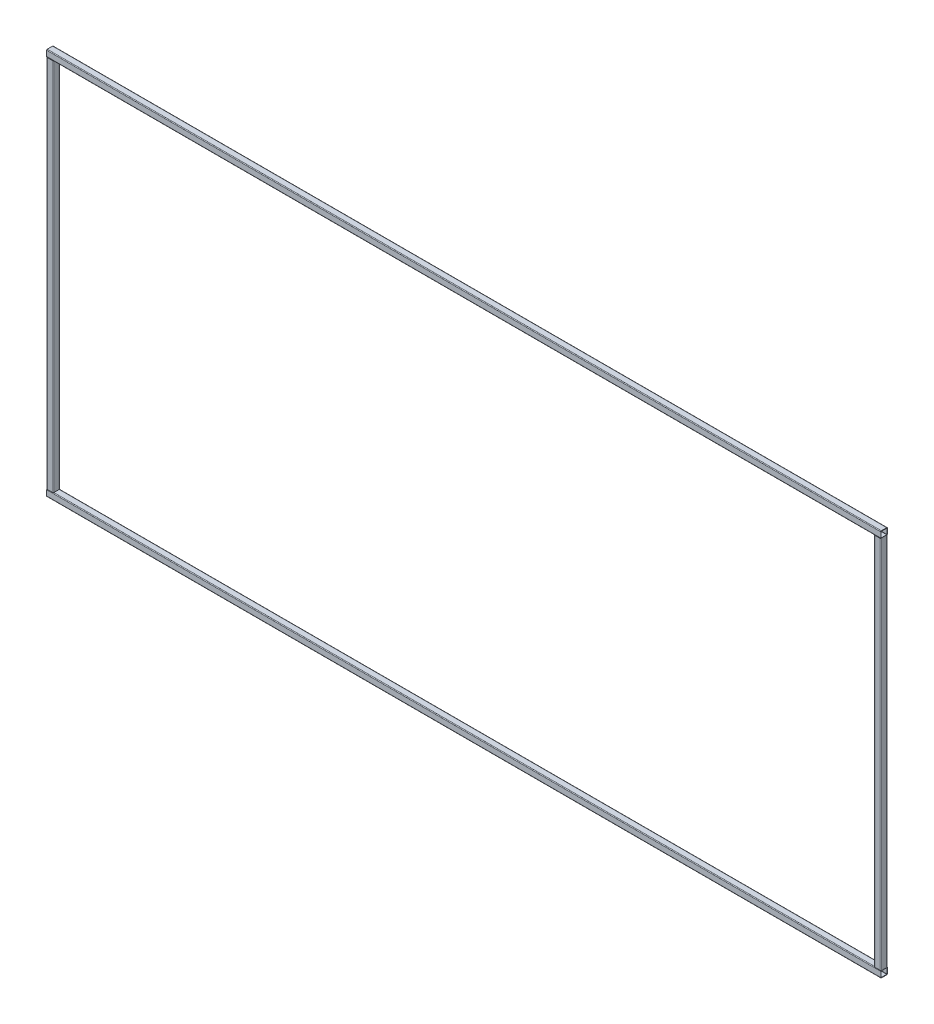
ISO-10303-21;
HEADER;
FILE_DESCRIPTION(('STEP AP214'),'2;1');
FILE_NAME('part.step','',(''),(''),'','','');
FILE_SCHEMA(('AUTOMOTIVE_DESIGN { 1 0 10303 214 1 1 1 1 }'));
ENDSEC;
DATA;
#1=APPLICATION_CONTEXT('core data for automotive mechanical design processes');
#2=APPLICATION_PROTOCOL_DEFINITION('international standard','automotive_design',2000,#1);
#3=PRODUCT_CONTEXT('',#1,'mechanical');
#4=PRODUCT('Part','Part','',(#3));
#5=PRODUCT_RELATED_PRODUCT_CATEGORY('part','',(#4));
#6=PRODUCT_DEFINITION_FORMATION('','',#4);
#7=PRODUCT_DEFINITION_CONTEXT('part definition',#1,'design');
#8=PRODUCT_DEFINITION('design','',#6,#7);
#9=PRODUCT_DEFINITION_SHAPE('','',#8);
#10=(LENGTH_UNIT() NAMED_UNIT(*) SI_UNIT(.MILLI.,.METRE.));
#11=(NAMED_UNIT(*) PLANE_ANGLE_UNIT() SI_UNIT($,.RADIAN.));
#12=(NAMED_UNIT(*) SI_UNIT($,.STERADIAN.) SOLID_ANGLE_UNIT());
#13=UNCERTAINTY_MEASURE_WITH_UNIT(LENGTH_MEASURE(1.E-05),#10,'distance_accuracy_value','');
#14=(GEOMETRIC_REPRESENTATION_CONTEXT(3) GLOBAL_UNCERTAINTY_ASSIGNED_CONTEXT((#13)) GLOBAL_UNIT_ASSIGNED_CONTEXT((#10,
#11,#12)) REPRESENTATION_CONTEXT('',''));
#15=CARTESIAN_POINT('',(0.,0.,0.));
#16=DIRECTION('',(0.,0.,1.));
#17=DIRECTION('',(1.,0.,0.));
#18=AXIS2_PLACEMENT_3D('',#15,#16,#17);
#19=CARTESIAN_POINT('',(2500.,1134.,16.));
#20=DIRECTION('',(-1.,0.,0.));
#21=DIRECTION('',(0.,0.,1.));
#22=AXIS2_PLACEMENT_3D('',#19,#20,#21);
#23=CYLINDRICAL_SURFACE('',#22,4.00000000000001);
#24=CARTESIAN_POINT('',(-2520.,1134.,16.));
#25=DIRECTION('',(-1.,0.,0.));
#26=DIRECTION('',(0.,0.,1.));
#27=AXIS2_PLACEMENT_3D('',#24,#25,#26);
#28=CIRCLE('',#27,4.00000000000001);
#29=CARTESIAN_POINT('',(-2520.,1130.,16.));
#30=VERTEX_POINT('',#29);
#31=CARTESIAN_POINT('',(-2520.,1134.,20.));
#32=VERTEX_POINT('',#31);
#33=EDGE_CURVE('E199',#30,#32,#28,.T.);
#34=ORIENTED_EDGE('',*,*,#33,.F.);
#35=DIRECTION('',(-1.,0.,0.));
#36=VECTOR('',#35,1.);
#37=CARTESIAN_POINT('',(2500.,1130.,16.));
#38=LINE('',#37,#36);
#39=CARTESIAN_POINT('',(2520.,1130.,16.));
#40=VERTEX_POINT('',#39);
#41=EDGE_CURVE('E88',#40,#30,#38,.T.);
#42=ORIENTED_EDGE('',*,*,#41,.F.);
#43=CARTESIAN_POINT('',(2520.,1134.,16.));
#44=DIRECTION('',(1.,0.,0.));
#45=DIRECTION('',(0.,0.,-1.));
#46=AXIS2_PLACEMENT_3D('',#43,#44,#45);
#47=CIRCLE('',#46,4.00000000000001);
#48=CARTESIAN_POINT('',(2520.,1134.,20.));
#49=VERTEX_POINT('',#48);
#50=EDGE_CURVE('E211',#49,#40,#47,.T.);
#51=ORIENTED_EDGE('',*,*,#50,.F.);
#52=DIRECTION('',(-1.,0.,0.));
#53=VECTOR('',#52,1.);
#54=CARTESIAN_POINT('',(2500.,1134.,20.));
#55=LINE('',#54,#53);
#56=EDGE_CURVE('E230',#49,#32,#55,.T.);
#57=ORIENTED_EDGE('',*,*,#56,.T.);
#58=EDGE_LOOP('',(#34,#42,#51,#57));
#59=FACE_BOUND('',#58,.T.);
#60=ADVANCED_FACE('F74',(#59),#23,.T.);
#61=CARTESIAN_POINT('',(2500.,1130.,-16.));
#62=DIRECTION('',(0.,1.,0.));
#63=DIRECTION('',(0.,0.,1.));
#64=AXIS2_PLACEMENT_3D('',#61,#62,#63);
#65=PLANE('',#64);
#66=DIRECTION('',(0.,0.,1.));
#67=VECTOR('',#66,1.);
#68=CARTESIAN_POINT('',(-2520.,1130.,-16.));
#69=LINE('',#68,#67);
#70=CARTESIAN_POINT('',(-2520.,1130.,-16.));
#71=VERTEX_POINT('',#70);
#72=EDGE_CURVE('E269',#71,#30,#69,.T.);
#73=ORIENTED_EDGE('',*,*,#72,.F.);
#74=DIRECTION('',(-1.,0.,0.));
#75=VECTOR('',#74,1.);
#76=CARTESIAN_POINT('',(2500.,1130.,-16.));
#77=LINE('',#76,#75);
#78=CARTESIAN_POINT('',(2520.,1130.,-16.));
#79=VERTEX_POINT('',#78);
#80=EDGE_CURVE('E208',#79,#71,#77,.T.);
#81=ORIENTED_EDGE('',*,*,#80,.F.);
#82=DIRECTION('',(0.,0.,-1.));
#83=VECTOR('',#82,1.);
#84=CARTESIAN_POINT('',(2520.,1130.,-16.));
#85=LINE('',#84,#83);
#86=EDGE_CURVE('E320',#40,#79,#85,.T.);
#87=ORIENTED_EDGE('',*,*,#86,.F.);
#88=ORIENTED_EDGE('',*,*,#41,.T.);
#89=EDGE_LOOP('',(#73,#81,#87,#88));
#90=FACE_BOUND('',#89,.T.);
#91=ADVANCED_FACE('F328',(#90),#65,.F.);
#92=CARTESIAN_POINT('',(2500.,1134.,-16.));
#93=DIRECTION('',(-1.,0.,0.));
#94=DIRECTION('',(0.,0.,1.));
#95=AXIS2_PLACEMENT_3D('',#92,#93,#94);
#96=CYLINDRICAL_SURFACE('',#95,4.00000000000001);
#97=CARTESIAN_POINT('',(-2520.,1134.,-16.));
#98=DIRECTION('',(-1.,0.,0.));
#99=DIRECTION('',(0.,0.,1.));
#100=AXIS2_PLACEMENT_3D('',#97,#98,#99);
#101=CIRCLE('',#100,4.00000000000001);
#102=CARTESIAN_POINT('',(-2520.,1134.,-20.));
#103=VERTEX_POINT('',#102);
#104=EDGE_CURVE('E272',#103,#71,#101,.T.);
#105=ORIENTED_EDGE('',*,*,#104,.F.);
#106=DIRECTION('',(-1.,0.,0.));
#107=VECTOR('',#106,1.);
#108=CARTESIAN_POINT('',(2500.,1134.,-20.));
#109=LINE('',#108,#107);
#110=CARTESIAN_POINT('',(2520.,1134.,-20.));
#111=VERTEX_POINT('',#110);
#112=EDGE_CURVE('E244',#111,#103,#109,.T.);
#113=ORIENTED_EDGE('',*,*,#112,.F.);
#114=CARTESIAN_POINT('',(2520.,1134.,-16.));
#115=DIRECTION('',(1.,0.,0.));
#116=DIRECTION('',(0.,0.,-1.));
#117=AXIS2_PLACEMENT_3D('',#114,#115,#116);
#118=CIRCLE('',#117,4.00000000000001);
#119=EDGE_CURVE('E318',#79,#111,#118,.T.);
#120=ORIENTED_EDGE('',*,*,#119,.F.);
#121=ORIENTED_EDGE('',*,*,#80,.T.);
#122=EDGE_LOOP('',(#105,#113,#120,#121));
#123=FACE_BOUND('',#122,.T.);
#124=ADVANCED_FACE('F330',(#123),#96,.T.);
#125=CARTESIAN_POINT('',(2500.,1166.,-20.));
#126=DIRECTION('',(0.,0.,1.));
#127=DIRECTION('',(0.,-1.,0.));
#128=AXIS2_PLACEMENT_3D('',#125,#126,#127);
#129=PLANE('',#128);
#130=DIRECTION('',(0.,-1.,0.));
#131=VECTOR('',#130,1.);
#132=CARTESIAN_POINT('',(-2520.,1166.,-20.));
#133=LINE('',#132,#131);
#134=CARTESIAN_POINT('',(-2520.,1166.,-20.));
#135=VERTEX_POINT('',#134);
#136=EDGE_CURVE('E275',#135,#103,#133,.T.);
#137=ORIENTED_EDGE('',*,*,#136,.F.);
#138=DIRECTION('',(-1.,0.,0.));
#139=VECTOR('',#138,1.);
#140=CARTESIAN_POINT('',(2500.,1166.,-20.));
#141=LINE('',#140,#139);
#142=CARTESIAN_POINT('',(2520.,1166.,-20.));
#143=VERTEX_POINT('',#142);
#144=EDGE_CURVE('E241',#143,#135,#141,.T.);
#145=ORIENTED_EDGE('',*,*,#144,.F.);
#146=DIRECTION('',(0.,1.,0.));
#147=VECTOR('',#146,1.);
#148=CARTESIAN_POINT('',(2520.,1166.,-20.));
#149=LINE('',#148,#147);
#150=EDGE_CURVE('E315',#111,#143,#149,.T.);
#151=ORIENTED_EDGE('',*,*,#150,.F.);
#152=ORIENTED_EDGE('',*,*,#112,.T.);
#153=EDGE_LOOP('',(#137,#145,#151,#152));
#154=FACE_BOUND('',#153,.T.);
#155=ADVANCED_FACE('F334',(#154),#129,.F.);
#156=CARTESIAN_POINT('',(2500.,1166.,-16.));
#157=DIRECTION('',(-1.,0.,0.));
#158=DIRECTION('',(0.,0.,1.));
#159=AXIS2_PLACEMENT_3D('',#156,#157,#158);
#160=CYLINDRICAL_SURFACE('',#159,4.00000000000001);
#161=CARTESIAN_POINT('',(-2520.,1166.,-16.));
#162=DIRECTION('',(-1.,0.,0.));
#163=DIRECTION('',(0.,0.,1.));
#164=AXIS2_PLACEMENT_3D('',#161,#162,#163);
#165=CIRCLE('',#164,4.00000000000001);
#166=CARTESIAN_POINT('',(-2520.,1170.,-16.));
#167=VERTEX_POINT('',#166);
#168=EDGE_CURVE('E278',#167,#135,#165,.T.);
#169=ORIENTED_EDGE('',*,*,#168,.F.);
#170=DIRECTION('',(-1.,0.,0.));
#171=VECTOR('',#170,1.);
#172=CARTESIAN_POINT('',(2500.,1170.,-16.));
#173=LINE('',#172,#171);
#174=CARTESIAN_POINT('',(2520.,1170.,-16.));
#175=VERTEX_POINT('',#174);
#176=EDGE_CURVE('E238',#175,#167,#173,.T.);
#177=ORIENTED_EDGE('',*,*,#176,.F.);
#178=CARTESIAN_POINT('',(2520.,1166.,-16.));
#179=DIRECTION('',(1.,0.,0.));
#180=DIRECTION('',(0.,0.,-1.));
#181=AXIS2_PLACEMENT_3D('',#178,#179,#180);
#182=CIRCLE('',#181,4.00000000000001);
#183=EDGE_CURVE('E312',#143,#175,#182,.T.);
#184=ORIENTED_EDGE('',*,*,#183,.F.);
#185=ORIENTED_EDGE('',*,*,#144,.T.);
#186=EDGE_LOOP('',(#169,#177,#184,#185));
#187=FACE_BOUND('',#186,.T.);
#188=ADVANCED_FACE('F336',(#187),#160,.T.);
#189=CARTESIAN_POINT('',(2500.,1170.,-16.));
#190=DIRECTION('',(0.,-1.,0.));
#191=DIRECTION('',(0.,0.,-1.));
#192=AXIS2_PLACEMENT_3D('',#189,#190,#191);
#193=PLANE('',#192);
#194=DIRECTION('',(0.,0.,-1.));
#195=VECTOR('',#194,1.);
#196=CARTESIAN_POINT('',(-2520.,1170.,-16.));
#197=LINE('',#196,#195);
#198=CARTESIAN_POINT('',(-2520.,1170.,16.));
#199=VERTEX_POINT('',#198);
#200=EDGE_CURVE('E281',#199,#167,#197,.T.);
#201=ORIENTED_EDGE('',*,*,#200,.F.);
#202=DIRECTION('',(-1.,0.,0.));
#203=VECTOR('',#202,1.);
#204=CARTESIAN_POINT('',(2500.,1170.,16.));
#205=LINE('',#204,#203);
#206=CARTESIAN_POINT('',(2520.,1170.,16.));
#207=VERTEX_POINT('',#206);
#208=EDGE_CURVE('E235',#207,#199,#205,.T.);
#209=ORIENTED_EDGE('',*,*,#208,.F.);
#210=DIRECTION('',(0.,0.,1.));
#211=VECTOR('',#210,1.);
#212=CARTESIAN_POINT('',(2520.,1170.,-16.));
#213=LINE('',#212,#211);
#214=EDGE_CURVE('E309',#175,#207,#213,.T.);
#215=ORIENTED_EDGE('',*,*,#214,.F.);
#216=ORIENTED_EDGE('',*,*,#176,.T.);
#217=EDGE_LOOP('',(#201,#209,#215,#216));
#218=FACE_BOUND('',#217,.T.);
#219=ADVANCED_FACE('F340',(#218),#193,.F.);
#220=CARTESIAN_POINT('',(2500.,1166.,16.));
#221=DIRECTION('',(-1.,0.,0.));
#222=DIRECTION('',(0.,0.,1.));
#223=AXIS2_PLACEMENT_3D('',#220,#221,#222);
#224=CYLINDRICAL_SURFACE('',#223,4.00000000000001);
#225=CARTESIAN_POINT('',(-2520.,1166.,16.));
#226=DIRECTION('',(-1.,0.,0.));
#227=DIRECTION('',(0.,0.,1.));
#228=AXIS2_PLACEMENT_3D('',#225,#226,#227);
#229=CIRCLE('',#228,4.00000000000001);
#230=CARTESIAN_POINT('',(-2520.,1166.,20.));
#231=VERTEX_POINT('',#230);
#232=EDGE_CURVE('E284',#231,#199,#229,.T.);
#233=ORIENTED_EDGE('',*,*,#232,.F.);
#234=DIRECTION('',(-1.,0.,0.));
#235=VECTOR('',#234,1.);
#236=CARTESIAN_POINT('',(2500.,1166.,20.));
#237=LINE('',#236,#235);
#238=CARTESIAN_POINT('',(2520.,1166.,20.));
#239=VERTEX_POINT('',#238);
#240=EDGE_CURVE('E232',#239,#231,#237,.T.);
#241=ORIENTED_EDGE('',*,*,#240,.F.);
#242=CARTESIAN_POINT('',(2520.,1166.,16.));
#243=DIRECTION('',(1.,0.,0.));
#244=DIRECTION('',(0.,0.,-1.));
#245=AXIS2_PLACEMENT_3D('',#242,#243,#244);
#246=CIRCLE('',#245,4.00000000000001);
#247=EDGE_CURVE('E306',#207,#239,#246,.T.);
#248=ORIENTED_EDGE('',*,*,#247,.F.);
#249=ORIENTED_EDGE('',*,*,#208,.T.);
#250=EDGE_LOOP('',(#233,#241,#248,#249));
#251=FACE_BOUND('',#250,.T.);
#252=ADVANCED_FACE('F342',(#251),#224,.T.);
#253=CARTESIAN_POINT('',(2500.,1166.,20.));
#254=DIRECTION('',(0.,0.,-1.));
#255=DIRECTION('',(0.,1.,0.));
#256=AXIS2_PLACEMENT_3D('',#253,#254,#255);
#257=PLANE('',#256);
#258=DIRECTION('',(0.,1.,0.));
#259=VECTOR('',#258,1.);
#260=CARTESIAN_POINT('',(-2520.,1166.,20.));
#261=LINE('',#260,#259);
#262=EDGE_CURVE('E257',#32,#231,#261,.T.);
#263=ORIENTED_EDGE('',*,*,#262,.F.);
#264=ORIENTED_EDGE('',*,*,#56,.F.);
#265=DIRECTION('',(0.,-1.,0.));
#266=VECTOR('',#265,1.);
#267=CARTESIAN_POINT('',(2520.,1166.,20.));
#268=LINE('',#267,#266);
#269=EDGE_CURVE('E303',#239,#49,#268,.T.);
#270=ORIENTED_EDGE('',*,*,#269,.F.);
#271=ORIENTED_EDGE('',*,*,#240,.T.);
#272=EDGE_LOOP('',(#263,#264,#270,#271));
#273=FACE_BOUND('',#272,.T.);
#274=ADVANCED_FACE('F344',(#273),#257,.F.);
#275=CARTESIAN_POINT('',(2520.,1150.,-20.));
#276=DIRECTION('',(1.,0.,0.));
#277=DIRECTION('',(0.,0.,-1.));
#278=AXIS2_PLACEMENT_3D('',#275,#276,#277);
#279=PLANE('',#278);
#280=CARTESIAN_POINT('',(2520.,1166.,-16.));
#281=DIRECTION('',(1.,0.,0.));
#282=DIRECTION('',(0.,0.,-1.));
#283=AXIS2_PLACEMENT_3D('',#280,#281,#282);
#284=CIRCLE('',#283,0.999999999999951);
#285=CARTESIAN_POINT('',(2520.,1166.,-17.));
#286=VERTEX_POINT('',#285);
#287=CARTESIAN_POINT('',(2520.,1167.,-16.));
#288=VERTEX_POINT('',#287);
#289=EDGE_CURVE('E204',#286,#288,#284,.T.);
#290=ORIENTED_EDGE('',*,*,#289,.F.);
#291=DIRECTION('',(0.,1.,0.));
#292=VECTOR('',#291,1.);
#293=CARTESIAN_POINT('',(2520.,1166.,-17.));
#294=LINE('',#293,#292);
#295=CARTESIAN_POINT('',(2520.,1134.,-16.9999999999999));
#296=VERTEX_POINT('',#295);
#297=EDGE_CURVE('E299',#296,#286,#294,.T.);
#298=ORIENTED_EDGE('',*,*,#297,.F.);
#299=CARTESIAN_POINT('',(2520.,1134.,-16.));
#300=DIRECTION('',(1.,0.,0.));
#301=DIRECTION('',(0.,0.,-1.));
#302=AXIS2_PLACEMENT_3D('',#299,#300,#301);
#303=CIRCLE('',#302,0.999999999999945);
#304=CARTESIAN_POINT('',(2520.,1133.,-16.));
#305=VERTEX_POINT('',#304);
#306=EDGE_CURVE('E296',#305,#296,#303,.T.);
#307=ORIENTED_EDGE('',*,*,#306,.F.);
#308=DIRECTION('',(0.,0.,-1.));
#309=VECTOR('',#308,1.);
#310=CARTESIAN_POINT('',(2520.,1133.,-16.));
#311=LINE('',#310,#309);
#312=CARTESIAN_POINT('',(2520.,1133.,16.));
#313=VERTEX_POINT('',#312);
#314=EDGE_CURVE('E293',#313,#305,#311,.T.);
#315=ORIENTED_EDGE('',*,*,#314,.F.);
#316=CARTESIAN_POINT('',(2520.,1134.,16.));
#317=DIRECTION('',(1.,0.,0.));
#318=DIRECTION('',(0.,0.,-1.));
#319=AXIS2_PLACEMENT_3D('',#316,#317,#318);
#320=CIRCLE('',#319,0.999999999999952);
#321=CARTESIAN_POINT('',(2520.,1134.,17.));
#322=VERTEX_POINT('',#321);
#323=EDGE_CURVE('E290',#322,#313,#320,.T.);
#324=ORIENTED_EDGE('',*,*,#323,.F.);
#325=DIRECTION('',(0.,-1.,0.));
#326=VECTOR('',#325,1.);
#327=CARTESIAN_POINT('',(2520.,1166.,17.));
#328=LINE('',#327,#326);
#329=CARTESIAN_POINT('',(2520.,1166.,16.9999999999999));
#330=VERTEX_POINT('',#329);
#331=EDGE_CURVE('E254',#330,#322,#328,.T.);
#332=ORIENTED_EDGE('',*,*,#331,.F.);
#333=CARTESIAN_POINT('',(2520.,1166.,16.));
#334=DIRECTION('',(1.,0.,0.));
#335=DIRECTION('',(0.,0.,-1.));
#336=AXIS2_PLACEMENT_3D('',#333,#334,#335);
#337=CIRCLE('',#336,0.999999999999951);
#338=CARTESIAN_POINT('',(2520.,1167.,16.));
#339=VERTEX_POINT('',#338);
#340=EDGE_CURVE('E252',#339,#330,#337,.T.);
#341=ORIENTED_EDGE('',*,*,#340,.F.);
#342=DIRECTION('',(0.,0.,1.));
#343=VECTOR('',#342,1.);
#344=CARTESIAN_POINT('',(2520.,1167.,-16.));
#345=LINE('',#344,#343);
#346=EDGE_CURVE('E81',#288,#339,#345,.T.);
#347=ORIENTED_EDGE('',*,*,#346,.F.);
#348=EDGE_LOOP('',(#290,#298,#307,#315,#324,#332,#341,#347));
#349=FACE_BOUND('',#348,.T.);
#350=ORIENTED_EDGE('',*,*,#269,.T.);
#351=ORIENTED_EDGE('',*,*,#50,.T.);
#352=ORIENTED_EDGE('',*,*,#86,.T.);
#353=ORIENTED_EDGE('',*,*,#119,.T.);
#354=ORIENTED_EDGE('',*,*,#150,.T.);
#355=ORIENTED_EDGE('',*,*,#183,.T.);
#356=ORIENTED_EDGE('',*,*,#214,.T.);
#357=ORIENTED_EDGE('',*,*,#247,.T.);
#358=EDGE_LOOP('',(#350,#351,#352,#353,#354,#355,#356,#357));
#359=FACE_BOUND('',#358,.T.);
#360=ADVANCED_FACE('F249',(#349,#359),#279,.T.);
#361=CARTESIAN_POINT('',(2500.,1166.,-16.));
#362=DIRECTION('',(-1.,0.,0.));
#363=DIRECTION('',(0.,0.,1.));
#364=AXIS2_PLACEMENT_3D('',#361,#362,#363);
#365=CYLINDRICAL_SURFACE('',#364,0.999999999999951);
#366=DIRECTION('',(-1.,0.,0.));
#367=VECTOR('',#366,1.);
#368=CARTESIAN_POINT('',(2500.,1167.,-16.));
#369=LINE('',#368,#367);
#370=CARTESIAN_POINT('',(-2520.,1167.,-16.));
#371=VERTEX_POINT('',#370);
#372=EDGE_CURVE('E195',#288,#371,#369,.T.);
#373=ORIENTED_EDGE('',*,*,#372,.T.);
#374=CARTESIAN_POINT('',(-2520.,1166.,-16.));
#375=DIRECTION('',(-1.,0.,0.));
#376=DIRECTION('',(0.,0.,1.));
#377=AXIS2_PLACEMENT_3D('',#374,#375,#376);
#378=CIRCLE('',#377,0.999999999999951);
#379=CARTESIAN_POINT('',(-2520.,1166.,-17.));
#380=VERTEX_POINT('',#379);
#381=EDGE_CURVE('E13',#371,#380,#378,.T.);
#382=ORIENTED_EDGE('',*,*,#381,.T.);
#383=DIRECTION('',(-1.,0.,0.));
#384=VECTOR('',#383,1.);
#385=CARTESIAN_POINT('',(2500.,1166.,-17.));
#386=LINE('',#385,#384);
#387=EDGE_CURVE('E228',#286,#380,#386,.T.);
#388=ORIENTED_EDGE('',*,*,#387,.F.);
#389=ORIENTED_EDGE('',*,*,#289,.T.);
#390=EDGE_LOOP('',(#373,#382,#388,#389));
#391=FACE_BOUND('',#390,.T.);
#392=ADVANCED_FACE('F203',(#391),#365,.F.);
#393=CARTESIAN_POINT('',(2500.,1166.,-17.));
#394=DIRECTION('',(0.,0.,1.));
#395=DIRECTION('',(1.,0.,0.));
#396=AXIS2_PLACEMENT_3D('',#393,#394,#395);
#397=PLANE('',#396);
#398=ORIENTED_EDGE('',*,*,#387,.T.);
#399=DIRECTION('',(0.,-1.,0.));
#400=VECTOR('',#399,1.);
#401=CARTESIAN_POINT('',(-2520.,1166.,-17.));
#402=LINE('',#401,#400);
#403=CARTESIAN_POINT('',(-2520.,1134.,-17.));
#404=VERTEX_POINT('',#403);
#405=EDGE_CURVE('E96',#380,#404,#402,.T.);
#406=ORIENTED_EDGE('',*,*,#405,.T.);
#407=DIRECTION('',(-1.,0.,0.));
#408=VECTOR('',#407,1.);
#409=CARTESIAN_POINT('',(2500.,1134.,-16.9999999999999));
#410=LINE('',#409,#408);
#411=EDGE_CURVE('E225',#296,#404,#410,.T.);
#412=ORIENTED_EDGE('',*,*,#411,.F.);
#413=ORIENTED_EDGE('',*,*,#297,.T.);
#414=EDGE_LOOP('',(#398,#406,#412,#413));
#415=FACE_BOUND('',#414,.T.);
#416=ADVANCED_FACE('F398',(#415),#397,.T.);
#417=CARTESIAN_POINT('',(2500.,1134.,-16.));
#418=DIRECTION('',(-1.,0.,0.));
#419=DIRECTION('',(0.,0.,1.));
#420=AXIS2_PLACEMENT_3D('',#417,#418,#419);
#421=CYLINDRICAL_SURFACE('',#420,0.999999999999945);
#422=ORIENTED_EDGE('',*,*,#411,.T.);
#423=CARTESIAN_POINT('',(-2520.,1134.,-16.));
#424=DIRECTION('',(-1.,0.,0.));
#425=DIRECTION('',(0.,0.,1.));
#426=AXIS2_PLACEMENT_3D('',#423,#424,#425);
#427=CIRCLE('',#426,0.999999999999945);
#428=CARTESIAN_POINT('',(-2520.,1133.,-16.));
#429=VERTEX_POINT('',#428);
#430=EDGE_CURVE('E553',#404,#429,#427,.T.);
#431=ORIENTED_EDGE('',*,*,#430,.T.);
#432=DIRECTION('',(-1.,0.,0.));
#433=VECTOR('',#432,1.);
#434=CARTESIAN_POINT('',(2500.,1133.,-16.));
#435=LINE('',#434,#433);
#436=EDGE_CURVE('E222',#305,#429,#435,.T.);
#437=ORIENTED_EDGE('',*,*,#436,.F.);
#438=ORIENTED_EDGE('',*,*,#306,.T.);
#439=EDGE_LOOP('',(#422,#431,#437,#438));
#440=FACE_BOUND('',#439,.T.);
#441=ADVANCED_FACE('F407',(#440),#421,.F.);
#442=CARTESIAN_POINT('',(2500.,1133.,-16.));
#443=DIRECTION('',(0.,1.,0.));
#444=DIRECTION('',(0.,0.,1.));
#445=AXIS2_PLACEMENT_3D('',#442,#443,#444);
#446=PLANE('',#445);
#447=ORIENTED_EDGE('',*,*,#436,.T.);
#448=DIRECTION('',(0.,0.,1.));
#449=VECTOR('',#448,1.);
#450=CARTESIAN_POINT('',(-2520.,1133.,-16.));
#451=LINE('',#450,#449);
#452=CARTESIAN_POINT('',(-2520.,1133.,16.));
#453=VERTEX_POINT('',#452);
#454=EDGE_CURVE('E552',#429,#453,#451,.T.);
#455=ORIENTED_EDGE('',*,*,#454,.T.);
#456=DIRECTION('',(-1.,0.,0.));
#457=VECTOR('',#456,1.);
#458=CARTESIAN_POINT('',(2500.,1133.,16.));
#459=LINE('',#458,#457);
#460=EDGE_CURVE('E219',#313,#453,#459,.T.);
#461=ORIENTED_EDGE('',*,*,#460,.F.);
#462=ORIENTED_EDGE('',*,*,#314,.T.);
#463=EDGE_LOOP('',(#447,#455,#461,#462));
#464=FACE_BOUND('',#463,.T.);
#465=ADVANCED_FACE('F418',(#464),#446,.T.);
#466=CARTESIAN_POINT('',(2500.,1134.,16.));
#467=DIRECTION('',(-1.,0.,0.));
#468=DIRECTION('',(0.,0.,1.));
#469=AXIS2_PLACEMENT_3D('',#466,#467,#468);
#470=CYLINDRICAL_SURFACE('',#469,0.999999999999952);
#471=ORIENTED_EDGE('',*,*,#460,.T.);
#472=CARTESIAN_POINT('',(-2520.,1134.,16.));
#473=DIRECTION('',(-1.,0.,0.));
#474=DIRECTION('',(0.,0.,1.));
#475=AXIS2_PLACEMENT_3D('',#472,#473,#474);
#476=CIRCLE('',#475,0.999999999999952);
#477=CARTESIAN_POINT('',(-2520.,1134.,16.9999999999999));
#478=VERTEX_POINT('',#477);
#479=EDGE_CURVE('E263',#453,#478,#476,.T.);
#480=ORIENTED_EDGE('',*,*,#479,.T.);
#481=DIRECTION('',(-1.,0.,0.));
#482=VECTOR('',#481,1.);
#483=CARTESIAN_POINT('',(2500.,1134.,17.));
#484=LINE('',#483,#482);
#485=EDGE_CURVE('E216',#322,#478,#484,.T.);
#486=ORIENTED_EDGE('',*,*,#485,.F.);
#487=ORIENTED_EDGE('',*,*,#323,.T.);
#488=EDGE_LOOP('',(#471,#480,#486,#487));
#489=FACE_BOUND('',#488,.T.);
#490=ADVANCED_FACE('F429',(#489),#470,.F.);
#491=CARTESIAN_POINT('',(2500.,1166.,17.));
#492=DIRECTION('',(0.,0.,-1.));
#493=DIRECTION('',(-1.,0.,0.));
#494=AXIS2_PLACEMENT_3D('',#491,#492,#493);
#495=PLANE('',#494);
#496=ORIENTED_EDGE('',*,*,#485,.T.);
#497=DIRECTION('',(0.,1.,0.));
#498=VECTOR('',#497,1.);
#499=CARTESIAN_POINT('',(-2520.,1166.,17.));
#500=LINE('',#499,#498);
#501=CARTESIAN_POINT('',(-2520.,1166.,17.));
#502=VERTEX_POINT('',#501);
#503=EDGE_CURVE('E261',#478,#502,#500,.T.);
#504=ORIENTED_EDGE('',*,*,#503,.T.);
#505=DIRECTION('',(-1.,0.,0.));
#506=VECTOR('',#505,1.);
#507=CARTESIAN_POINT('',(2500.,1166.,16.9999999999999));
#508=LINE('',#507,#506);
#509=EDGE_CURVE('E206',#330,#502,#508,.T.);
#510=ORIENTED_EDGE('',*,*,#509,.F.);
#511=ORIENTED_EDGE('',*,*,#331,.T.);
#512=EDGE_LOOP('',(#496,#504,#510,#511));
#513=FACE_BOUND('',#512,.T.);
#514=ADVANCED_FACE('F440',(#513),#495,.T.);
#515=CARTESIAN_POINT('',(2500.,1166.,16.));
#516=DIRECTION('',(-1.,0.,0.));
#517=DIRECTION('',(0.,0.,1.));
#518=AXIS2_PLACEMENT_3D('',#515,#516,#517);
#519=CYLINDRICAL_SURFACE('',#518,0.999999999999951);
#520=ORIENTED_EDGE('',*,*,#509,.T.);
#521=CARTESIAN_POINT('',(-2520.,1166.,16.));
#522=DIRECTION('',(-1.,0.,0.));
#523=DIRECTION('',(0.,0.,1.));
#524=AXIS2_PLACEMENT_3D('',#521,#522,#523);
#525=CIRCLE('',#524,0.999999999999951);
#526=CARTESIAN_POINT('',(-2520.,1167.,16.));
#527=VERTEX_POINT('',#526);
#528=EDGE_CURVE('E200',#502,#527,#525,.T.);
#529=ORIENTED_EDGE('',*,*,#528,.T.);
#530=DIRECTION('',(-1.,0.,0.));
#531=VECTOR('',#530,1.);
#532=CARTESIAN_POINT('',(2500.,1167.,16.));
#533=LINE('',#532,#531);
#534=EDGE_CURVE('E197',#339,#527,#533,.T.);
#535=ORIENTED_EDGE('',*,*,#534,.F.);
#536=ORIENTED_EDGE('',*,*,#340,.T.);
#537=EDGE_LOOP('',(#520,#529,#535,#536));
#538=FACE_BOUND('',#537,.T.);
#539=ADVANCED_FACE('F259',(#538),#519,.F.);
#540=CARTESIAN_POINT('',(2500.,1167.,-16.));
#541=DIRECTION('',(0.,-1.,0.));
#542=DIRECTION('',(0.,0.,-1.));
#543=AXIS2_PLACEMENT_3D('',#540,#541,#542);
#544=PLANE('',#543);
#545=ORIENTED_EDGE('',*,*,#534,.T.);
#546=DIRECTION('',(0.,0.,-1.));
#547=VECTOR('',#546,1.);
#548=CARTESIAN_POINT('',(-2520.,1167.,-16.));
#549=LINE('',#548,#547);
#550=EDGE_CURVE('E186',#527,#371,#549,.T.);
#551=ORIENTED_EDGE('',*,*,#550,.T.);
#552=ORIENTED_EDGE('',*,*,#372,.F.);
#553=ORIENTED_EDGE('',*,*,#346,.T.);
#554=EDGE_LOOP('',(#545,#551,#552,#553));
#555=FACE_BOUND('',#554,.T.);
#556=ADVANCED_FACE('F193',(#555),#544,.T.);
#557=CARTESIAN_POINT('',(-2520.,1150.,20.));
#558=DIRECTION('',(-1.,0.,0.));
#559=DIRECTION('',(0.,0.,1.));
#560=AXIS2_PLACEMENT_3D('',#557,#558,#559);
#561=PLANE('',#560);
#562=ORIENTED_EDGE('',*,*,#550,.F.);
#563=ORIENTED_EDGE('',*,*,#528,.F.);
#564=ORIENTED_EDGE('',*,*,#503,.F.);
#565=ORIENTED_EDGE('',*,*,#479,.F.);
#566=ORIENTED_EDGE('',*,*,#454,.F.);
#567=ORIENTED_EDGE('',*,*,#430,.F.);
#568=ORIENTED_EDGE('',*,*,#405,.F.);
#569=ORIENTED_EDGE('',*,*,#381,.F.);
#570=EDGE_LOOP('',(#562,#563,#564,#565,#566,#567,#568,#569));
#571=FACE_BOUND('',#570,.T.);
#572=ORIENTED_EDGE('',*,*,#33,.T.);
#573=ORIENTED_EDGE('',*,*,#262,.T.);
#574=ORIENTED_EDGE('',*,*,#232,.T.);
#575=ORIENTED_EDGE('',*,*,#200,.T.);
#576=ORIENTED_EDGE('',*,*,#168,.T.);
#577=ORIENTED_EDGE('',*,*,#136,.T.);
#578=ORIENTED_EDGE('',*,*,#104,.T.);
#579=ORIENTED_EDGE('',*,*,#72,.T.);
#580=EDGE_LOOP('',(#572,#573,#574,#575,#576,#577,#578,#579));
#581=FACE_BOUND('',#580,.T.);
#582=ADVANCED_FACE('F184',(#571,#581),#561,.T.);
#583=CLOSED_SHELL('',(#60,#91,#124,#155,#188,#219,#252,#274,#360,#392,#416,#441,#465,#490,#514,
#539,#556,#582));
#584=MANIFOLD_SOLID_BREP('B2',#583);
#585=CARTESIAN_POINT('',(-2516.,1150.,20.));
#586=DIRECTION('',(0.,0.,-1.));
#587=DIRECTION('',(-1.,0.,0.));
#588=AXIS2_PLACEMENT_3D('',#585,#586,#587);
#589=PLANE('',#588);
#590=DIRECTION('',(-1.,0.,0.));
#591=VECTOR('',#590,1.);
#592=CARTESIAN_POINT('',(2500.,1130.,20.));
#593=LINE('',#592,#591);
#594=CARTESIAN_POINT('',(-2484.,1130.,20.));
#595=VERTEX_POINT('',#594);
#596=CARTESIAN_POINT('',(-2516.,1130.,20.));
#597=VERTEX_POINT('',#596);
#598=EDGE_CURVE('E682',#595,#597,#593,.T.);
#599=ORIENTED_EDGE('',*,*,#598,.T.);
#600=DIRECTION('',(0.,-1.,0.));
#601=VECTOR('',#600,1.);
#602=CARTESIAN_POINT('',(-2516.,1150.,20.));
#603=LINE('',#602,#601);
#604=CARTESIAN_POINT('',(-2516.,-1130.,20.));
#605=VERTEX_POINT('',#604);
#606=EDGE_CURVE('E712',#597,#605,#603,.T.);
#607=ORIENTED_EDGE('',*,*,#606,.T.);
#608=DIRECTION('',(-1.,0.,0.));
#609=VECTOR('',#608,1.);
#610=CARTESIAN_POINT('',(2500.,-1130.,20.));
#611=LINE('',#610,#609);
#612=CARTESIAN_POINT('',(-2484.,-1130.,20.));
#613=VERTEX_POINT('',#612);
#614=EDGE_CURVE('E704',#613,#605,#611,.T.);
#615=ORIENTED_EDGE('',*,*,#614,.F.);
#616=DIRECTION('',(0.,-1.,0.));
#617=VECTOR('',#616,1.);
#618=CARTESIAN_POINT('',(-2484.,1150.,20.));
#619=LINE('',#618,#617);
#620=EDGE_CURVE('E696',#595,#613,#619,.T.);
#621=ORIENTED_EDGE('',*,*,#620,.F.);
#622=EDGE_LOOP('',(#599,#607,#615,#621));
#623=FACE_BOUND('',#622,.T.);
#624=ADVANCED_FACE('F573',(#623),#589,.F.);
#625=CARTESIAN_POINT('',(-2516.,1150.,16.));
#626=DIRECTION('',(0.,-1.,0.));
#627=DIRECTION('',(0.,0.,-1.));
#628=AXIS2_PLACEMENT_3D('',#625,#626,#627);
#629=CYLINDRICAL_SURFACE('',#628,4.00000000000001);
#630=CARTESIAN_POINT('',(-2516.,1130.,16.));
#631=DIRECTION('',(0.,1.,0.));
#632=DIRECTION('',(0.,0.,1.));
#633=AXIS2_PLACEMENT_3D('',#630,#631,#632);
#634=CIRCLE('',#633,4.00000000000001);
#635=CARTESIAN_POINT('',(-2520.,1130.,16.));
#636=VERTEX_POINT('',#635);
#637=EDGE_CURVE('E588',#636,#597,#634,.T.);
#638=ORIENTED_EDGE('',*,*,#637,.F.);
#639=DIRECTION('',(0.,-1.,0.));
#640=VECTOR('',#639,1.);
#641=CARTESIAN_POINT('',(-2520.,1150.,16.));
#642=LINE('',#641,#640);
#643=CARTESIAN_POINT('',(-2520.,-1130.,16.));
#644=VERTEX_POINT('',#643);
#645=EDGE_CURVE('E715',#636,#644,#642,.T.);
#646=ORIENTED_EDGE('',*,*,#645,.T.);
#647=CARTESIAN_POINT('',(-2516.,-1130.,16.));
#648=DIRECTION('',(0.,-1.,0.));
#649=DIRECTION('',(0.,0.,-1.));
#650=AXIS2_PLACEMENT_3D('',#647,#648,#649);
#651=CIRCLE('',#650,4.00000000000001);
#652=EDGE_CURVE('E747',#605,#644,#651,.T.);
#653=ORIENTED_EDGE('',*,*,#652,.F.);
#654=ORIENTED_EDGE('',*,*,#606,.F.);
#655=EDGE_LOOP('',(#638,#646,#653,#654));
#656=FACE_BOUND('',#655,.T.);
#657=ADVANCED_FACE('F830',(#656),#629,.T.);
#658=CARTESIAN_POINT('',(-2520.,1150.,-16.));
#659=DIRECTION('',(1.,0.,0.));
#660=DIRECTION('',(0.,0.,-1.));
#661=AXIS2_PLACEMENT_3D('',#658,#659,#660);
#662=PLANE('',#661);
#663=DIRECTION('',(0.,0.,1.));
#664=VECTOR('',#663,1.);
#665=CARTESIAN_POINT('',(-2520.,1130.,-16.));
#666=LINE('',#665,#664);
#667=CARTESIAN_POINT('',(-2520.,1130.,-16.));
#668=VERTEX_POINT('',#667);
#669=EDGE_CURVE('E783',#668,#636,#666,.T.);
#670=ORIENTED_EDGE('',*,*,#669,.F.);
#671=DIRECTION('',(0.,-1.,0.));
#672=VECTOR('',#671,1.);
#673=CARTESIAN_POINT('',(-2520.,1150.,-16.));
#674=LINE('',#673,#672);
#675=CARTESIAN_POINT('',(-2520.,-1130.,-16.));
#676=VERTEX_POINT('',#675);
#677=EDGE_CURVE('E717',#668,#676,#674,.T.);
#678=ORIENTED_EDGE('',*,*,#677,.T.);
#679=DIRECTION('',(0.,0.,-1.));
#680=VECTOR('',#679,1.);
#681=CARTESIAN_POINT('',(-2520.,-1130.,-16.));
#682=LINE('',#681,#680);
#683=EDGE_CURVE('E764',#644,#676,#682,.T.);
#684=ORIENTED_EDGE('',*,*,#683,.F.);
#685=ORIENTED_EDGE('',*,*,#645,.F.);
#686=EDGE_LOOP('',(#670,#678,#684,#685));
#687=FACE_BOUND('',#686,.T.);
#688=ADVANCED_FACE('F833',(#687),#662,.F.);
#689=CARTESIAN_POINT('',(-2516.,1150.,-16.));
#690=DIRECTION('',(0.,-1.,0.));
#691=DIRECTION('',(0.,0.,-1.));
#692=AXIS2_PLACEMENT_3D('',#689,#690,#691);
#693=CYLINDRICAL_SURFACE('',#692,4.00000000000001);
#694=CARTESIAN_POINT('',(-2516.,1130.,-16.));
#695=DIRECTION('',(0.,1.,0.));
#696=DIRECTION('',(0.,0.,1.));
#697=AXIS2_PLACEMENT_3D('',#694,#695,#696);
#698=CIRCLE('',#697,4.00000000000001);
#699=CARTESIAN_POINT('',(-2516.,1130.,-20.));
#700=VERTEX_POINT('',#699);
#701=EDGE_CURVE('E781',#700,#668,#698,.T.);
#702=ORIENTED_EDGE('',*,*,#701,.F.);
#703=DIRECTION('',(0.,-1.,0.));
#704=VECTOR('',#703,1.);
#705=CARTESIAN_POINT('',(-2516.,1150.,-20.));
#706=LINE('',#705,#704);
#707=CARTESIAN_POINT('',(-2516.,-1130.,-20.));
#708=VERTEX_POINT('',#707);
#709=EDGE_CURVE('E719',#700,#708,#706,.T.);
#710=ORIENTED_EDGE('',*,*,#709,.T.);
#711=CARTESIAN_POINT('',(-2516.,-1130.,-16.));
#712=DIRECTION('',(0.,-1.,0.));
#713=DIRECTION('',(0.,0.,-1.));
#714=AXIS2_PLACEMENT_3D('',#711,#712,#713);
#715=CIRCLE('',#714,4.00000000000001);
#716=EDGE_CURVE('E767',#676,#708,#715,.T.);
#717=ORIENTED_EDGE('',*,*,#716,.F.);
#718=ORIENTED_EDGE('',*,*,#677,.F.);
#719=EDGE_LOOP('',(#702,#710,#717,#718));
#720=FACE_BOUND('',#719,.T.);
#721=ADVANCED_FACE('F814',(#720),#693,.T.);
#722=CARTESIAN_POINT('',(-2516.,1150.,-20.));
#723=DIRECTION('',(0.,0.,1.));
#724=DIRECTION('',(1.,0.,0.));
#725=AXIS2_PLACEMENT_3D('',#722,#723,#724);
#726=PLANE('',#725);
#727=DIRECTION('',(-1.,0.,0.));
#728=VECTOR('',#727,1.);
#729=CARTESIAN_POINT('',(2500.,1130.,-20.));
#730=LINE('',#729,#728);
#731=CARTESIAN_POINT('',(-2484.,1130.,-20.));
#732=VERTEX_POINT('',#731);
#733=EDGE_CURVE('E690',#732,#700,#730,.T.);
#734=ORIENTED_EDGE('',*,*,#733,.F.);
#735=DIRECTION('',(0.,-1.,0.));
#736=VECTOR('',#735,1.);
#737=CARTESIAN_POINT('',(-2484.,1150.,-20.));
#738=LINE('',#737,#736);
#739=CARTESIAN_POINT('',(-2484.,-1130.,-20.));
#740=VERTEX_POINT('',#739);
#741=EDGE_CURVE('E721',#732,#740,#738,.T.);
#742=ORIENTED_EDGE('',*,*,#741,.T.);
#743=DIRECTION('',(-1.,0.,0.));
#744=VECTOR('',#743,1.);
#745=CARTESIAN_POINT('',(2500.,-1130.,-20.));
#746=LINE('',#745,#744);
#747=EDGE_CURVE('E723',#740,#708,#746,.T.);
#748=ORIENTED_EDGE('',*,*,#747,.T.);
#749=ORIENTED_EDGE('',*,*,#709,.F.);
#750=EDGE_LOOP('',(#734,#742,#748,#749));
#751=FACE_BOUND('',#750,.T.);
#752=ADVANCED_FACE('F816',(#751),#726,.F.);
#753=CARTESIAN_POINT('',(-2484.,1150.,-16.));
#754=DIRECTION('',(0.,-1.,0.));
#755=DIRECTION('',(0.,0.,-1.));
#756=AXIS2_PLACEMENT_3D('',#753,#754,#755);
#757=CYLINDRICAL_SURFACE('',#756,4.00000000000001);
#758=CARTESIAN_POINT('',(-2484.,1130.,-16.));
#759=DIRECTION('',(0.,1.,0.));
#760=DIRECTION('',(0.,0.,1.));
#761=AXIS2_PLACEMENT_3D('',#758,#759,#760);
#762=CIRCLE('',#761,4.00000000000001);
#763=CARTESIAN_POINT('',(-2480.,1130.,-16.));
#764=VERTEX_POINT('',#763);
#765=EDGE_CURVE('E779',#764,#732,#762,.T.);
#766=ORIENTED_EDGE('',*,*,#765,.F.);
#767=DIRECTION('',(0.,-1.,0.));
#768=VECTOR('',#767,1.);
#769=CARTESIAN_POINT('',(-2480.,1150.,-16.));
#770=LINE('',#769,#768);
#771=CARTESIAN_POINT('',(-2480.,-1130.,-16.));
#772=VERTEX_POINT('',#771);
#773=EDGE_CURVE('E706',#764,#772,#770,.T.);
#774=ORIENTED_EDGE('',*,*,#773,.T.);
#775=CARTESIAN_POINT('',(-2484.,-1130.,-16.));
#776=DIRECTION('',(0.,-1.,0.));
#777=DIRECTION('',(0.,0.,-1.));
#778=AXIS2_PLACEMENT_3D('',#775,#776,#777);
#779=CIRCLE('',#778,4.00000000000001);
#780=EDGE_CURVE('E770',#740,#772,#779,.T.);
#781=ORIENTED_EDGE('',*,*,#780,.F.);
#782=ORIENTED_EDGE('',*,*,#741,.F.);
#783=EDGE_LOOP('',(#766,#774,#781,#782));
#784=FACE_BOUND('',#783,.T.);
#785=ADVANCED_FACE('F823',(#784),#757,.T.);
#786=CARTESIAN_POINT('',(-2480.,1150.,-16.));
#787=DIRECTION('',(-1.,0.,0.));
#788=DIRECTION('',(0.,0.,1.));
#789=AXIS2_PLACEMENT_3D('',#786,#787,#788);
#790=PLANE('',#789);
#791=DIRECTION('',(0.,0.,-1.));
#792=VECTOR('',#791,1.);
#793=CARTESIAN_POINT('',(-2480.,1130.,-16.));
#794=LINE('',#793,#792);
#795=CARTESIAN_POINT('',(-2480.,1130.,16.));
#796=VERTEX_POINT('',#795);
#797=EDGE_CURVE('E700',#796,#764,#794,.T.);
#798=ORIENTED_EDGE('',*,*,#797,.F.);
#799=DIRECTION('',(0.,-1.,0.));
#800=VECTOR('',#799,1.);
#801=CARTESIAN_POINT('',(-2480.,1150.,16.));
#802=LINE('',#801,#800);
#803=CARTESIAN_POINT('',(-2480.,-1130.,16.));
#804=VERTEX_POINT('',#803);
#805=EDGE_CURVE('E698',#796,#804,#802,.T.);
#806=ORIENTED_EDGE('',*,*,#805,.T.);
#807=DIRECTION('',(0.,0.,1.));
#808=VECTOR('',#807,1.);
#809=CARTESIAN_POINT('',(-2480.,-1130.,-16.));
#810=LINE('',#809,#808);
#811=EDGE_CURVE('E581',#772,#804,#810,.T.);
#812=ORIENTED_EDGE('',*,*,#811,.F.);
#813=ORIENTED_EDGE('',*,*,#773,.F.);
#814=EDGE_LOOP('',(#798,#806,#812,#813));
#815=FACE_BOUND('',#814,.T.);
#816=ADVANCED_FACE('F826',(#815),#790,.F.);
#817=CARTESIAN_POINT('',(-2484.,1150.,16.));
#818=DIRECTION('',(0.,-1.,0.));
#819=DIRECTION('',(0.,0.,-1.));
#820=AXIS2_PLACEMENT_3D('',#817,#818,#819);
#821=CYLINDRICAL_SURFACE('',#820,4.00000000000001);
#822=CARTESIAN_POINT('',(-2484.,1130.,16.));
#823=DIRECTION('',(0.,1.,0.));
#824=DIRECTION('',(0.,0.,1.));
#825=AXIS2_PLACEMENT_3D('',#822,#823,#824);
#826=CIRCLE('',#825,4.00000000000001);
#827=EDGE_CURVE('E685',#595,#796,#826,.T.);
#828=ORIENTED_EDGE('',*,*,#827,.F.);
#829=ORIENTED_EDGE('',*,*,#620,.T.);
#830=CARTESIAN_POINT('',(-2484.,-1130.,16.));
#831=DIRECTION('',(0.,-1.,0.));
#832=DIRECTION('',(0.,0.,-1.));
#833=AXIS2_PLACEMENT_3D('',#830,#831,#832);
#834=CIRCLE('',#833,4.00000000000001);
#835=EDGE_CURVE('E748',#804,#613,#834,.T.);
#836=ORIENTED_EDGE('',*,*,#835,.F.);
#837=ORIENTED_EDGE('',*,*,#805,.F.);
#838=EDGE_LOOP('',(#828,#829,#836,#837));
#839=FACE_BOUND('',#838,.T.);
#840=ADVANCED_FACE('F694',(#839),#821,.T.);
#841=CARTESIAN_POINT('',(2500.,-1130.,-16.));
#842=DIRECTION('',(0.,-1.,0.));
#843=DIRECTION('',(0.,0.,-1.));
#844=AXIS2_PLACEMENT_3D('',#841,#842,#843);
#845=PLANE('',#844);
#846=DIRECTION('',(0.,0.,-1.));
#847=VECTOR('',#846,1.);
#848=CARTESIAN_POINT('',(-2517.,-1130.,-16.));
#849=LINE('',#848,#847);
#850=CARTESIAN_POINT('',(-2517.,-1130.,16.));
#851=VERTEX_POINT('',#850);
#852=CARTESIAN_POINT('',(-2517.,-1130.,-16.));
#853=VERTEX_POINT('',#852);
#854=EDGE_CURVE('E728',#851,#853,#849,.T.);
#855=ORIENTED_EDGE('',*,*,#854,.F.);
#856=CARTESIAN_POINT('',(-2516.,-1130.,16.));
#857=DIRECTION('',(0.,-1.,0.));
#858=DIRECTION('',(0.,0.,-1.));
#859=AXIS2_PLACEMENT_3D('',#856,#857,#858);
#860=CIRCLE('',#859,0.999999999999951);
#861=CARTESIAN_POINT('',(-2516.,-1130.,16.9999999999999));
#862=VERTEX_POINT('',#861);
#863=EDGE_CURVE('E705',#862,#851,#860,.T.);
#864=ORIENTED_EDGE('',*,*,#863,.F.);
#865=DIRECTION('',(-1.,0.,0.));
#866=VECTOR('',#865,1.);
#867=CARTESIAN_POINT('',(-2516.,-1130.,17.));
#868=LINE('',#867,#866);
#869=CARTESIAN_POINT('',(-2484.,-1130.,17.));
#870=VERTEX_POINT('',#869);
#871=EDGE_CURVE('E730',#870,#862,#868,.T.);
#872=ORIENTED_EDGE('',*,*,#871,.F.);
#873=CARTESIAN_POINT('',(-2484.,-1130.,16.));
#874=DIRECTION('',(0.,-1.,0.));
#875=DIRECTION('',(0.,0.,-1.));
#876=AXIS2_PLACEMENT_3D('',#873,#874,#875);
#877=CIRCLE('',#876,0.999999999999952);
#878=CARTESIAN_POINT('',(-2483.,-1130.,16.));
#879=VERTEX_POINT('',#878);
#880=EDGE_CURVE('E733',#879,#870,#877,.T.);
#881=ORIENTED_EDGE('',*,*,#880,.F.);
#882=DIRECTION('',(0.,0.,1.));
#883=VECTOR('',#882,1.);
#884=CARTESIAN_POINT('',(-2483.,-1130.,-16.));
#885=LINE('',#884,#883);
#886=CARTESIAN_POINT('',(-2483.,-1130.,-16.));
#887=VERTEX_POINT('',#886);
#888=EDGE_CURVE('E736',#887,#879,#885,.T.);
#889=ORIENTED_EDGE('',*,*,#888,.F.);
#890=CARTESIAN_POINT('',(-2484.,-1130.,-16.));
#891=DIRECTION('',(0.,-1.,0.));
#892=DIRECTION('',(0.,0.,-1.));
#893=AXIS2_PLACEMENT_3D('',#890,#891,#892);
#894=CIRCLE('',#893,0.999999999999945);
#895=CARTESIAN_POINT('',(-2484.,-1130.,-16.9999999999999));
#896=VERTEX_POINT('',#895);
#897=EDGE_CURVE('E739',#896,#887,#894,.T.);
#898=ORIENTED_EDGE('',*,*,#897,.F.);
#899=DIRECTION('',(1.,0.,0.));
#900=VECTOR('',#899,1.);
#901=CARTESIAN_POINT('',(-2516.,-1130.,-17.));
#902=LINE('',#901,#900);
#903=CARTESIAN_POINT('',(-2516.,-1130.,-17.));
#904=VERTEX_POINT('',#903);
#905=EDGE_CURVE('E742',#904,#896,#902,.T.);
#906=ORIENTED_EDGE('',*,*,#905,.F.);
#907=CARTESIAN_POINT('',(-2516.,-1130.,-16.));
#908=DIRECTION('',(0.,-1.,0.));
#909=DIRECTION('',(0.,0.,-1.));
#910=AXIS2_PLACEMENT_3D('',#907,#908,#909);
#911=CIRCLE('',#910,0.999999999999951);
#912=EDGE_CURVE('E726',#853,#904,#911,.T.);
#913=ORIENTED_EDGE('',*,*,#912,.F.);
#914=EDGE_LOOP('',(#855,#864,#872,#881,#889,#898,#906,#913));
#915=FACE_BOUND('',#914,.T.);
#916=ORIENTED_EDGE('',*,*,#835,.T.);
#917=ORIENTED_EDGE('',*,*,#614,.T.);
#918=ORIENTED_EDGE('',*,*,#652,.T.);
#919=ORIENTED_EDGE('',*,*,#683,.T.);
#920=ORIENTED_EDGE('',*,*,#716,.T.);
#921=ORIENTED_EDGE('',*,*,#747,.F.);
#922=ORIENTED_EDGE('',*,*,#780,.T.);
#923=ORIENTED_EDGE('',*,*,#811,.T.);
#924=EDGE_LOOP('',(#916,#917,#918,#919,#920,#921,#922,#923));
#925=FACE_BOUND('',#924,.T.);
#926=ADVANCED_FACE('F820',(#915,#925),#845,.T.);
#927=CARTESIAN_POINT('',(-2517.,1150.,-16.));
#928=DIRECTION('',(1.,0.,0.));
#929=DIRECTION('',(0.,0.,-1.));
#930=AXIS2_PLACEMENT_3D('',#927,#928,#929);
#931=PLANE('',#930);
#932=DIRECTION('',(0.,-1.,0.));
#933=VECTOR('',#932,1.);
#934=CARTESIAN_POINT('',(-2517.,1150.,-16.));
#935=LINE('',#934,#933);
#936=CARTESIAN_POINT('',(-2517.,1130.,-16.));
#937=VERTEX_POINT('',#936);
#938=EDGE_CURVE('E699',#937,#853,#935,.T.);
#939=ORIENTED_EDGE('',*,*,#938,.F.);
#940=DIRECTION('',(0.,0.,1.));
#941=VECTOR('',#940,1.);
#942=CARTESIAN_POINT('',(-2517.,1130.,-16.));
#943=LINE('',#942,#941);
#944=CARTESIAN_POINT('',(-2517.,1130.,16.));
#945=VERTEX_POINT('',#944);
#946=EDGE_CURVE('E72',#937,#945,#943,.T.);
#947=ORIENTED_EDGE('',*,*,#946,.T.);
#948=DIRECTION('',(0.,-1.,0.));
#949=VECTOR('',#948,1.);
#950=CARTESIAN_POINT('',(-2517.,1150.,16.));
#951=LINE('',#950,#949);
#952=EDGE_CURVE('E714',#945,#851,#951,.T.);
#953=ORIENTED_EDGE('',*,*,#952,.T.);
#954=ORIENTED_EDGE('',*,*,#854,.T.);
#955=EDGE_LOOP('',(#939,#947,#953,#954));
#956=FACE_BOUND('',#955,.T.);
#957=ADVANCED_FACE('F849',(#956),#931,.T.);
#958=CARTESIAN_POINT('',(-2516.,1150.,16.));
#959=DIRECTION('',(0.,-1.,0.));
#960=DIRECTION('',(0.,0.,-1.));
#961=AXIS2_PLACEMENT_3D('',#958,#959,#960);
#962=CYLINDRICAL_SURFACE('',#961,0.999999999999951);
#963=ORIENTED_EDGE('',*,*,#952,.F.);
#964=CARTESIAN_POINT('',(-2516.,1130.,16.));
#965=DIRECTION('',(0.,1.,0.));
#966=DIRECTION('',(0.,0.,1.));
#967=AXIS2_PLACEMENT_3D('',#964,#965,#966);
#968=CIRCLE('',#967,0.999999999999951);
#969=CARTESIAN_POINT('',(-2516.,1130.,16.9999999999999));
#970=VERTEX_POINT('',#969);
#971=EDGE_CURVE('E596',#945,#970,#968,.T.);
#972=ORIENTED_EDGE('',*,*,#971,.T.);
#973=DIRECTION('',(0.,-1.,0.));
#974=VECTOR('',#973,1.);
#975=CARTESIAN_POINT('',(-2516.,1150.,16.9999999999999));
#976=LINE('',#975,#974);
#977=EDGE_CURVE('E709',#970,#862,#976,.T.);
#978=ORIENTED_EDGE('',*,*,#977,.T.);
#979=ORIENTED_EDGE('',*,*,#863,.T.);
#980=EDGE_LOOP('',(#963,#972,#978,#979));
#981=FACE_BOUND('',#980,.T.);
#982=ADVANCED_FACE('F874',(#981),#962,.F.);
#983=CARTESIAN_POINT('',(-2516.,1150.,17.));
#984=DIRECTION('',(0.,0.,-1.));
#985=DIRECTION('',(-1.,0.,0.));
#986=AXIS2_PLACEMENT_3D('',#983,#984,#985);
#987=PLANE('',#986);
#988=ORIENTED_EDGE('',*,*,#977,.F.);
#989=DIRECTION('',(1.,0.,0.));
#990=VECTOR('',#989,1.);
#991=CARTESIAN_POINT('',(-2516.,1130.,17.));
#992=LINE('',#991,#990);
#993=CARTESIAN_POINT('',(-2484.,1130.,17.));
#994=VERTEX_POINT('',#993);
#995=EDGE_CURVE('E801',#970,#994,#992,.T.);
#996=ORIENTED_EDGE('',*,*,#995,.T.);
#997=DIRECTION('',(0.,-1.,0.));
#998=VECTOR('',#997,1.);
#999=CARTESIAN_POINT('',(-2484.,1150.,17.));
#1000=LINE('',#999,#998);
#1001=EDGE_CURVE('E731',#994,#870,#1000,.T.);
#1002=ORIENTED_EDGE('',*,*,#1001,.T.);
#1003=ORIENTED_EDGE('',*,*,#871,.T.);
#1004=EDGE_LOOP('',(#988,#996,#1002,#1003));
#1005=FACE_BOUND('',#1004,.T.);
#1006=ADVANCED_FACE('F877',(#1005),#987,.T.);
#1007=CARTESIAN_POINT('',(-2484.,1150.,16.));
#1008=DIRECTION('',(0.,-1.,0.));
#1009=DIRECTION('',(0.,0.,-1.));
#1010=AXIS2_PLACEMENT_3D('',#1007,#1008,#1009);
#1011=CYLINDRICAL_SURFACE('',#1010,0.999999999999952);
#1012=ORIENTED_EDGE('',*,*,#1001,.F.);
#1013=CARTESIAN_POINT('',(-2484.,1130.,16.));
#1014=DIRECTION('',(0.,1.,0.));
#1015=DIRECTION('',(0.,0.,1.));
#1016=AXIS2_PLACEMENT_3D('',#1013,#1014,#1015);
#1017=CIRCLE('',#1016,0.999999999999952);
#1018=CARTESIAN_POINT('',(-2483.,1130.,16.));
#1019=VERTEX_POINT('',#1018);
#1020=EDGE_CURVE('E798',#994,#1019,#1017,.T.);
#1021=ORIENTED_EDGE('',*,*,#1020,.T.);
#1022=DIRECTION('',(0.,-1.,0.));
#1023=VECTOR('',#1022,1.);
#1024=CARTESIAN_POINT('',(-2483.,1150.,16.));
#1025=LINE('',#1024,#1023);
#1026=EDGE_CURVE('E734',#1019,#879,#1025,.T.);
#1027=ORIENTED_EDGE('',*,*,#1026,.T.);
#1028=ORIENTED_EDGE('',*,*,#880,.T.);
#1029=EDGE_LOOP('',(#1012,#1021,#1027,#1028));
#1030=FACE_BOUND('',#1029,.T.);
#1031=ADVANCED_FACE('F881',(#1030),#1011,.F.);
#1032=CARTESIAN_POINT('',(-2483.,1150.,-16.));
#1033=DIRECTION('',(-1.,0.,0.));
#1034=DIRECTION('',(0.,0.,1.));
#1035=AXIS2_PLACEMENT_3D('',#1032,#1033,#1034);
#1036=PLANE('',#1035);
#1037=ORIENTED_EDGE('',*,*,#1026,.F.);
#1038=DIRECTION('',(0.,0.,-1.));
#1039=VECTOR('',#1038,1.);
#1040=CARTESIAN_POINT('',(-2483.,1130.,-16.));
#1041=LINE('',#1040,#1039);
#1042=CARTESIAN_POINT('',(-2483.,1130.,-16.));
#1043=VERTEX_POINT('',#1042);
#1044=EDGE_CURVE('E795',#1019,#1043,#1041,.T.);
#1045=ORIENTED_EDGE('',*,*,#1044,.T.);
#1046=DIRECTION('',(0.,-1.,0.));
#1047=VECTOR('',#1046,1.);
#1048=CARTESIAN_POINT('',(-2483.,1150.,-16.));
#1049=LINE('',#1048,#1047);
#1050=EDGE_CURVE('E737',#1043,#887,#1049,.T.);
#1051=ORIENTED_EDGE('',*,*,#1050,.T.);
#1052=ORIENTED_EDGE('',*,*,#888,.T.);
#1053=EDGE_LOOP('',(#1037,#1045,#1051,#1052));
#1054=FACE_BOUND('',#1053,.T.);
#1055=ADVANCED_FACE('F884',(#1054),#1036,.T.);
#1056=CARTESIAN_POINT('',(-2484.,1150.,-16.));
#1057=DIRECTION('',(0.,-1.,0.));
#1058=DIRECTION('',(0.,0.,-1.));
#1059=AXIS2_PLACEMENT_3D('',#1056,#1057,#1058);
#1060=CYLINDRICAL_SURFACE('',#1059,0.999999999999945);
#1061=ORIENTED_EDGE('',*,*,#1050,.F.);
#1062=CARTESIAN_POINT('',(-2484.,1130.,-16.));
#1063=DIRECTION('',(0.,1.,0.));
#1064=DIRECTION('',(0.,0.,1.));
#1065=AXIS2_PLACEMENT_3D('',#1062,#1063,#1064);
#1066=CIRCLE('',#1065,0.999999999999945);
#1067=CARTESIAN_POINT('',(-2484.,1130.,-16.9999999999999));
#1068=VERTEX_POINT('',#1067);
#1069=EDGE_CURVE('E792',#1043,#1068,#1066,.T.);
#1070=ORIENTED_EDGE('',*,*,#1069,.T.);
#1071=DIRECTION('',(0.,-1.,0.));
#1072=VECTOR('',#1071,1.);
#1073=CARTESIAN_POINT('',(-2484.,1150.,-16.9999999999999));
#1074=LINE('',#1073,#1072);
#1075=EDGE_CURVE('E740',#1068,#896,#1074,.T.);
#1076=ORIENTED_EDGE('',*,*,#1075,.T.);
#1077=ORIENTED_EDGE('',*,*,#897,.T.);
#1078=EDGE_LOOP('',(#1061,#1070,#1076,#1077));
#1079=FACE_BOUND('',#1078,.T.);
#1080=ADVANCED_FACE('F862',(#1079),#1060,.F.);
#1081=CARTESIAN_POINT('',(-2516.,1150.,-17.));
#1082=DIRECTION('',(0.,0.,1.));
#1083=DIRECTION('',(1.,0.,0.));
#1084=AXIS2_PLACEMENT_3D('',#1081,#1082,#1083);
#1085=PLANE('',#1084);
#1086=ORIENTED_EDGE('',*,*,#1075,.F.);
#1087=DIRECTION('',(-1.,0.,0.));
#1088=VECTOR('',#1087,1.);
#1089=CARTESIAN_POINT('',(-2516.,1130.,-17.));
#1090=LINE('',#1089,#1088);
#1091=CARTESIAN_POINT('',(-2516.,1130.,-17.));
#1092=VERTEX_POINT('',#1091);
#1093=EDGE_CURVE('E789',#1068,#1092,#1090,.T.);
#1094=ORIENTED_EDGE('',*,*,#1093,.T.);
#1095=DIRECTION('',(0.,-1.,0.));
#1096=VECTOR('',#1095,1.);
#1097=CARTESIAN_POINT('',(-2516.,1150.,-17.));
#1098=LINE('',#1097,#1096);
#1099=EDGE_CURVE('E743',#1092,#904,#1098,.T.);
#1100=ORIENTED_EDGE('',*,*,#1099,.T.);
#1101=ORIENTED_EDGE('',*,*,#905,.T.);
#1102=EDGE_LOOP('',(#1086,#1094,#1100,#1101));
#1103=FACE_BOUND('',#1102,.T.);
#1104=ADVANCED_FACE('F855',(#1103),#1085,.T.);
#1105=CARTESIAN_POINT('',(-2516.,1150.,-16.));
#1106=DIRECTION('',(0.,-1.,0.));
#1107=DIRECTION('',(0.,0.,-1.));
#1108=AXIS2_PLACEMENT_3D('',#1105,#1106,#1107);
#1109=CYLINDRICAL_SURFACE('',#1108,0.999999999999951);
#1110=ORIENTED_EDGE('',*,*,#1099,.F.);
#1111=CARTESIAN_POINT('',(-2516.,1130.,-16.));
#1112=DIRECTION('',(0.,1.,0.));
#1113=DIRECTION('',(0.,0.,1.));
#1114=AXIS2_PLACEMENT_3D('',#1111,#1112,#1113);
#1115=CIRCLE('',#1114,0.999999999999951);
#1116=EDGE_CURVE('E786',#1092,#937,#1115,.T.);
#1117=ORIENTED_EDGE('',*,*,#1116,.T.);
#1118=ORIENTED_EDGE('',*,*,#938,.T.);
#1119=ORIENTED_EDGE('',*,*,#912,.T.);
#1120=EDGE_LOOP('',(#1110,#1117,#1118,#1119));
#1121=FACE_BOUND('',#1120,.T.);
#1122=ADVANCED_FACE('F575',(#1121),#1109,.F.);
#1123=CARTESIAN_POINT('',(2500.,1130.,-16.));
#1124=DIRECTION('',(0.,1.,0.));
#1125=DIRECTION('',(0.,0.,1.));
#1126=AXIS2_PLACEMENT_3D('',#1123,#1124,#1125);
#1127=PLANE('',#1126);
#1128=ORIENTED_EDGE('',*,*,#1093,.F.);
#1129=ORIENTED_EDGE('',*,*,#1069,.F.);
#1130=ORIENTED_EDGE('',*,*,#1044,.F.);
#1131=ORIENTED_EDGE('',*,*,#1020,.F.);
#1132=ORIENTED_EDGE('',*,*,#995,.F.);
#1133=ORIENTED_EDGE('',*,*,#971,.F.);
#1134=ORIENTED_EDGE('',*,*,#946,.F.);
#1135=ORIENTED_EDGE('',*,*,#1116,.F.);
#1136=EDGE_LOOP('',(#1128,#1129,#1130,#1131,#1132,#1133,#1134,#1135));
#1137=FACE_BOUND('',#1136,.T.);
#1138=ORIENTED_EDGE('',*,*,#827,.T.);
#1139=ORIENTED_EDGE('',*,*,#797,.T.);
#1140=ORIENTED_EDGE('',*,*,#765,.T.);
#1141=ORIENTED_EDGE('',*,*,#733,.T.);
#1142=ORIENTED_EDGE('',*,*,#701,.T.);
#1143=ORIENTED_EDGE('',*,*,#669,.T.);
#1144=ORIENTED_EDGE('',*,*,#637,.T.);
#1145=ORIENTED_EDGE('',*,*,#598,.F.);
#1146=EDGE_LOOP('',(#1138,#1139,#1140,#1141,#1142,#1143,#1144,#1145));
#1147=FACE_BOUND('',#1146,.T.);
#1148=ADVANCED_FACE('F684',(#1137,#1147),#1127,.T.);
#1149=CLOSED_SHELL('',(#624,#657,#688,#721,#752,#785,#816,#840,#926,#957,#982,#1006,#1031,#1055,
#1080,#1104,#1122,#1148));
#1150=MANIFOLD_SOLID_BREP('B7',#1149);
#1151=CARTESIAN_POINT('',(2484.,1150.,20.));
#1152=DIRECTION('',(0.,0.,-1.));
#1153=DIRECTION('',(-1.,0.,0.));
#1154=AXIS2_PLACEMENT_3D('',#1151,#1152,#1153);
#1155=PLANE('',#1154);
#1156=DIRECTION('',(-1.,0.,0.));
#1157=VECTOR('',#1156,1.);
#1158=CARTESIAN_POINT('',(2500.,1130.,20.));
#1159=LINE('',#1158,#1157);
#1160=CARTESIAN_POINT('',(2516.,1130.,20.));
#1161=VERTEX_POINT('',#1160);
#1162=CARTESIAN_POINT('',(2484.,1130.,20.));
#1163=VERTEX_POINT('',#1162);
#1164=EDGE_CURVE('E1200',#1161,#1163,#1159,.T.);
#1165=ORIENTED_EDGE('',*,*,#1164,.T.);
#1166=DIRECTION('',(0.,-1.,0.));
#1167=VECTOR('',#1166,1.);
#1168=CARTESIAN_POINT('',(2484.,1150.,20.));
#1169=LINE('',#1168,#1167);
#1170=CARTESIAN_POINT('',(2484.,-1130.,20.));
#1171=VERTEX_POINT('',#1170);
#1172=EDGE_CURVE('E1218',#1163,#1171,#1169,.T.);
#1173=ORIENTED_EDGE('',*,*,#1172,.T.);
#1174=DIRECTION('',(-1.,0.,0.));
#1175=VECTOR('',#1174,1.);
#1176=CARTESIAN_POINT('',(2500.,-1130.,20.));
#1177=LINE('',#1176,#1175);
#1178=CARTESIAN_POINT('',(2516.,-1130.,20.));
#1179=VERTEX_POINT('',#1178);
#1180=EDGE_CURVE('E1239',#1179,#1171,#1177,.T.);
#1181=ORIENTED_EDGE('',*,*,#1180,.F.);
#1182=DIRECTION('',(0.,-1.,0.));
#1183=VECTOR('',#1182,1.);
#1184=CARTESIAN_POINT('',(2516.,1150.,20.));
#1185=LINE('',#1184,#1183);
#1186=EDGE_CURVE('E1220',#1161,#1179,#1185,.T.);
#1187=ORIENTED_EDGE('',*,*,#1186,.F.);
#1188=EDGE_LOOP('',(#1165,#1173,#1181,#1187));
#1189=FACE_BOUND('',#1188,.T.);
#1190=ADVANCED_FACE('F1071',(#1189),#1155,.F.);
#1191=CARTESIAN_POINT('',(2484.,1150.,16.));
#1192=DIRECTION('',(0.,-1.,0.));
#1193=DIRECTION('',(0.,0.,-1.));
#1194=AXIS2_PLACEMENT_3D('',#1191,#1192,#1193);
#1195=CYLINDRICAL_SURFACE('',#1194,4.00000000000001);
#1196=CARTESIAN_POINT('',(2484.,1130.,16.));
#1197=DIRECTION('',(0.,1.,0.));
#1198=DIRECTION('',(0.,0.,1.));
#1199=AXIS2_PLACEMENT_3D('',#1196,#1197,#1198);
#1200=CIRCLE('',#1199,4.00000000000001);
#1201=CARTESIAN_POINT('',(2480.,1130.,16.));
#1202=VERTEX_POINT('',#1201);
#1203=EDGE_CURVE('E1086',#1202,#1163,#1200,.T.);
#1204=ORIENTED_EDGE('',*,*,#1203,.F.);
#1205=DIRECTION('',(0.,-1.,0.));
#1206=VECTOR('',#1205,1.);
#1207=CARTESIAN_POINT('',(2480.,1150.,16.));
#1208=LINE('',#1207,#1206);
#1209=CARTESIAN_POINT('',(2480.,-1130.,16.));
#1210=VERTEX_POINT('',#1209);
#1211=EDGE_CURVE('E1216',#1202,#1210,#1208,.T.);
#1212=ORIENTED_EDGE('',*,*,#1211,.T.);
#1213=CARTESIAN_POINT('',(2484.,-1130.,16.));
#1214=DIRECTION('',(0.,-1.,0.));
#1215=DIRECTION('',(0.,0.,-1.));
#1216=AXIS2_PLACEMENT_3D('',#1213,#1214,#1215);
#1217=CIRCLE('',#1216,4.00000000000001);
#1218=EDGE_CURVE('E1241',#1171,#1210,#1217,.T.);
#1219=ORIENTED_EDGE('',*,*,#1218,.F.);
#1220=ORIENTED_EDGE('',*,*,#1172,.F.);
#1221=EDGE_LOOP('',(#1204,#1212,#1219,#1220));
#1222=FACE_BOUND('',#1221,.T.);
#1223=ADVANCED_FACE('F1357',(#1222),#1195,.T.);
#1224=CARTESIAN_POINT('',(2480.,1150.,-16.));
#1225=DIRECTION('',(1.,0.,0.));
#1226=DIRECTION('',(0.,0.,-1.));
#1227=AXIS2_PLACEMENT_3D('',#1224,#1225,#1226);
#1228=PLANE('',#1227);
#1229=DIRECTION('',(0.,0.,1.));
#1230=VECTOR('',#1229,1.);
#1231=CARTESIAN_POINT('',(2480.,1130.,-16.));
#1232=LINE('',#1231,#1230);
#1233=CARTESIAN_POINT('',(2480.,1130.,-16.));
#1234=VERTEX_POINT('',#1233);
#1235=EDGE_CURVE('E1342',#1234,#1202,#1232,.T.);
#1236=ORIENTED_EDGE('',*,*,#1235,.F.);
#1237=DIRECTION('',(0.,-1.,0.));
#1238=VECTOR('',#1237,1.);
#1239=CARTESIAN_POINT('',(2480.,1150.,-16.));
#1240=LINE('',#1239,#1238);
#1241=CARTESIAN_POINT('',(2480.,-1130.,-16.));
#1242=VERTEX_POINT('',#1241);
#1243=EDGE_CURVE('E1208',#1234,#1242,#1240,.T.);
#1244=ORIENTED_EDGE('',*,*,#1243,.T.);
#1245=DIRECTION('',(0.,0.,-1.));
#1246=VECTOR('',#1245,1.);
#1247=CARTESIAN_POINT('',(2480.,-1130.,-16.));
#1248=LINE('',#1247,#1246);
#1249=EDGE_CURVE('E1281',#1210,#1242,#1248,.T.);
#1250=ORIENTED_EDGE('',*,*,#1249,.F.);
#1251=ORIENTED_EDGE('',*,*,#1211,.F.);
#1252=EDGE_LOOP('',(#1236,#1244,#1250,#1251));
#1253=FACE_BOUND('',#1252,.T.);
#1254=ADVANCED_FACE('F1349',(#1253),#1228,.F.);
#1255=CARTESIAN_POINT('',(2484.,1150.,-16.));
#1256=DIRECTION('',(0.,-1.,0.));
#1257=DIRECTION('',(0.,0.,-1.));
#1258=AXIS2_PLACEMENT_3D('',#1255,#1256,#1257);
#1259=CYLINDRICAL_SURFACE('',#1258,4.00000000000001);
#1260=CARTESIAN_POINT('',(2484.,1130.,-16.));
#1261=DIRECTION('',(0.,1.,0.));
#1262=DIRECTION('',(0.,0.,1.));
#1263=AXIS2_PLACEMENT_3D('',#1260,#1261,#1262);
#1264=CIRCLE('',#1263,4.00000000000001);
#1265=CARTESIAN_POINT('',(2484.,1130.,-20.));
#1266=VERTEX_POINT('',#1265);
#1267=EDGE_CURVE('E1191',#1266,#1234,#1264,.T.);
#1268=ORIENTED_EDGE('',*,*,#1267,.F.);
#1269=DIRECTION('',(0.,-1.,0.));
#1270=VECTOR('',#1269,1.);
#1271=CARTESIAN_POINT('',(2484.,1150.,-20.));
#1272=LINE('',#1271,#1270);
#1273=CARTESIAN_POINT('',(2484.,-1130.,-20.));
#1274=VERTEX_POINT('',#1273);
#1275=EDGE_CURVE('E1199',#1266,#1274,#1272,.T.);
#1276=ORIENTED_EDGE('',*,*,#1275,.T.);
#1277=CARTESIAN_POINT('',(2484.,-1130.,-16.));
#1278=DIRECTION('',(0.,-1.,0.));
#1279=DIRECTION('',(0.,0.,-1.));
#1280=AXIS2_PLACEMENT_3D('',#1277,#1278,#1279);
#1281=CIRCLE('',#1280,4.00000000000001);
#1282=EDGE_CURVE('E1278',#1242,#1274,#1281,.T.);
#1283=ORIENTED_EDGE('',*,*,#1282,.F.);
#1284=ORIENTED_EDGE('',*,*,#1243,.F.);
#1285=EDGE_LOOP('',(#1268,#1276,#1283,#1284));
#1286=FACE_BOUND('',#1285,.T.);
#1287=ADVANCED_FACE('F1352',(#1286),#1259,.T.);
#1288=CARTESIAN_POINT('',(2484.,1150.,-20.));
#1289=DIRECTION('',(0.,0.,1.));
#1290=DIRECTION('',(1.,0.,0.));
#1291=AXIS2_PLACEMENT_3D('',#1288,#1289,#1290);
#1292=PLANE('',#1291);
#1293=DIRECTION('',(-1.,0.,0.));
#1294=VECTOR('',#1293,1.);
#1295=CARTESIAN_POINT('',(2500.,1130.,-20.));
#1296=LINE('',#1295,#1294);
#1297=CARTESIAN_POINT('',(2516.,1130.,-20.));
#1298=VERTEX_POINT('',#1297);
#1299=EDGE_CURVE('E1184',#1298,#1266,#1296,.T.);
#1300=ORIENTED_EDGE('',*,*,#1299,.F.);
#1301=DIRECTION('',(0.,-1.,0.));
#1302=VECTOR('',#1301,1.);
#1303=CARTESIAN_POINT('',(2516.,1150.,-20.));
#1304=LINE('',#1303,#1302);
#1305=CARTESIAN_POINT('',(2516.,-1130.,-20.));
#1306=VERTEX_POINT('',#1305);
#1307=EDGE_CURVE('E1197',#1298,#1306,#1304,.T.);
#1308=ORIENTED_EDGE('',*,*,#1307,.T.);
#1309=DIRECTION('',(-1.,0.,0.));
#1310=VECTOR('',#1309,1.);
#1311=CARTESIAN_POINT('',(2500.,-1130.,-20.));
#1312=LINE('',#1311,#1310);
#1313=EDGE_CURVE('E1206',#1306,#1274,#1312,.T.);
#1314=ORIENTED_EDGE('',*,*,#1313,.T.);
#1315=ORIENTED_EDGE('',*,*,#1275,.F.);
#1316=EDGE_LOOP('',(#1300,#1308,#1314,#1315));
#1317=FACE_BOUND('',#1316,.T.);
#1318=ADVANCED_FACE('F1195',(#1317),#1292,.F.);
#1319=CARTESIAN_POINT('',(2516.,1150.,-16.));
#1320=DIRECTION('',(0.,-1.,0.));
#1321=DIRECTION('',(0.,0.,-1.));
#1322=AXIS2_PLACEMENT_3D('',#1319,#1320,#1321);
#1323=CYLINDRICAL_SURFACE('',#1322,4.00000000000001);
#1324=CARTESIAN_POINT('',(2516.,1130.,-16.));
#1325=DIRECTION('',(0.,1.,0.));
#1326=DIRECTION('',(0.,0.,1.));
#1327=AXIS2_PLACEMENT_3D('',#1324,#1325,#1326);
#1328=CIRCLE('',#1327,4.00000000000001);
#1329=CARTESIAN_POINT('',(2520.,1130.,-16.));
#1330=VERTEX_POINT('',#1329);
#1331=EDGE_CURVE('E1181',#1330,#1298,#1328,.T.);
#1332=ORIENTED_EDGE('',*,*,#1331,.F.);
#1333=DIRECTION('',(0.,-1.,0.));
#1334=VECTOR('',#1333,1.);
#1335=CARTESIAN_POINT('',(2520.,1150.,-16.));
#1336=LINE('',#1335,#1334);
#1337=CARTESIAN_POINT('',(2520.,-1130.,-16.));
#1338=VERTEX_POINT('',#1337);
#1339=EDGE_CURVE('E1210',#1330,#1338,#1336,.T.);
#1340=ORIENTED_EDGE('',*,*,#1339,.T.);
#1341=CARTESIAN_POINT('',(2516.,-1130.,-16.));
#1342=DIRECTION('',(0.,-1.,0.));
#1343=DIRECTION('',(0.,0.,-1.));
#1344=AXIS2_PLACEMENT_3D('',#1341,#1342,#1343);
#1345=CIRCLE('',#1344,4.00000000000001);
#1346=EDGE_CURVE('E1205',#1306,#1338,#1345,.T.);
#1347=ORIENTED_EDGE('',*,*,#1346,.F.);
#1348=ORIENTED_EDGE('',*,*,#1307,.F.);
#1349=EDGE_LOOP('',(#1332,#1340,#1347,#1348));
#1350=FACE_BOUND('',#1349,.T.);
#1351=ADVANCED_FACE('F1203',(#1350),#1323,.T.);
#1352=CARTESIAN_POINT('',(2520.,1150.,-16.));
#1353=DIRECTION('',(-1.,0.,0.));
#1354=DIRECTION('',(0.,0.,1.));
#1355=AXIS2_PLACEMENT_3D('',#1352,#1353,#1354);
#1356=PLANE('',#1355);
#1357=DIRECTION('',(0.,0.,-1.));
#1358=VECTOR('',#1357,1.);
#1359=CARTESIAN_POINT('',(2520.,1130.,-16.));
#1360=LINE('',#1359,#1358);
#1361=CARTESIAN_POINT('',(2520.,1130.,16.));
#1362=VERTEX_POINT('',#1361);
#1363=EDGE_CURVE('E1187',#1362,#1330,#1360,.T.);
#1364=ORIENTED_EDGE('',*,*,#1363,.F.);
#1365=DIRECTION('',(0.,-1.,0.));
#1366=VECTOR('',#1365,1.);
#1367=CARTESIAN_POINT('',(2520.,1150.,16.));
#1368=LINE('',#1367,#1366);
#1369=CARTESIAN_POINT('',(2520.,-1130.,16.));
#1370=VERTEX_POINT('',#1369);
#1371=EDGE_CURVE('E1221',#1362,#1370,#1368,.T.);
#1372=ORIENTED_EDGE('',*,*,#1371,.T.);
#1373=DIRECTION('',(0.,0.,1.));
#1374=VECTOR('',#1373,1.);
#1375=CARTESIAN_POINT('',(2520.,-1130.,-16.));
#1376=LINE('',#1375,#1374);
#1377=EDGE_CURVE('E1079',#1338,#1370,#1376,.T.);
#1378=ORIENTED_EDGE('',*,*,#1377,.F.);
#1379=ORIENTED_EDGE('',*,*,#1339,.F.);
#1380=EDGE_LOOP('',(#1364,#1372,#1378,#1379));
#1381=FACE_BOUND('',#1380,.T.);
#1382=ADVANCED_FACE('F1363',(#1381),#1356,.F.);
#1383=CARTESIAN_POINT('',(2516.,1150.,16.));
#1384=DIRECTION('',(0.,-1.,0.));
#1385=DIRECTION('',(0.,0.,-1.));
#1386=AXIS2_PLACEMENT_3D('',#1383,#1384,#1385);
#1387=CYLINDRICAL_SURFACE('',#1386,4.00000000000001);
#1388=CARTESIAN_POINT('',(2516.,1130.,16.));
#1389=DIRECTION('',(0.,1.,0.));
#1390=DIRECTION('',(0.,0.,1.));
#1391=AXIS2_PLACEMENT_3D('',#1388,#1389,#1390);
#1392=CIRCLE('',#1391,4.00000000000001);
#1393=EDGE_CURVE('E1262',#1161,#1362,#1392,.T.);
#1394=ORIENTED_EDGE('',*,*,#1393,.F.);
#1395=ORIENTED_EDGE('',*,*,#1186,.T.);
#1396=CARTESIAN_POINT('',(2516.,-1130.,16.));
#1397=DIRECTION('',(0.,-1.,0.));
#1398=DIRECTION('',(0.,0.,-1.));
#1399=AXIS2_PLACEMENT_3D('',#1396,#1397,#1398);
#1400=CIRCLE('',#1399,4.00000000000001);
#1401=EDGE_CURVE('E1242',#1370,#1179,#1400,.T.);
#1402=ORIENTED_EDGE('',*,*,#1401,.F.);
#1403=ORIENTED_EDGE('',*,*,#1371,.F.);
#1404=EDGE_LOOP('',(#1394,#1395,#1402,#1403));
#1405=FACE_BOUND('',#1404,.T.);
#1406=ADVANCED_FACE('F1360',(#1405),#1387,.T.);
#1407=CARTESIAN_POINT('',(2500.,-1130.,-16.));
#1408=DIRECTION('',(0.,-1.,0.));
#1409=DIRECTION('',(0.,0.,-1.));
#1410=AXIS2_PLACEMENT_3D('',#1407,#1408,#1409);
#1411=PLANE('',#1410);
#1412=DIRECTION('',(0.,0.,-1.));
#1413=VECTOR('',#1412,1.);
#1414=CARTESIAN_POINT('',(2483.,-1130.,-16.));
#1415=LINE('',#1414,#1413);
#1416=CARTESIAN_POINT('',(2483.,-1130.,16.));
#1417=VERTEX_POINT('',#1416);
#1418=CARTESIAN_POINT('',(2483.,-1130.,-16.));
#1419=VERTEX_POINT('',#1418);
#1420=EDGE_CURVE('E1260',#1417,#1419,#1415,.T.);
#1421=ORIENTED_EDGE('',*,*,#1420,.F.);
#1422=CARTESIAN_POINT('',(2484.,-1130.,16.));
#1423=DIRECTION('',(0.,-1.,0.));
#1424=DIRECTION('',(0.,0.,-1.));
#1425=AXIS2_PLACEMENT_3D('',#1422,#1423,#1424);
#1426=CIRCLE('',#1425,0.999999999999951);
#1427=CARTESIAN_POINT('',(2484.,-1130.,16.9999999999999));
#1428=VERTEX_POINT('',#1427);
#1429=EDGE_CURVE('E1222',#1428,#1417,#1426,.T.);
#1430=ORIENTED_EDGE('',*,*,#1429,.F.);
#1431=DIRECTION('',(-1.,0.,0.));
#1432=VECTOR('',#1431,1.);
#1433=CARTESIAN_POINT('',(2484.,-1130.,17.));
#1434=LINE('',#1433,#1432);
#1435=CARTESIAN_POINT('',(2516.,-1130.,17.));
#1436=VERTEX_POINT('',#1435);
#1437=EDGE_CURVE('E1234',#1436,#1428,#1434,.T.);
#1438=ORIENTED_EDGE('',*,*,#1437,.F.);
#1439=CARTESIAN_POINT('',(2516.,-1130.,16.));
#1440=DIRECTION('',(0.,-1.,0.));
#1441=DIRECTION('',(0.,0.,-1.));
#1442=AXIS2_PLACEMENT_3D('',#1439,#1440,#1441);
#1443=CIRCLE('',#1442,0.999999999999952);
#1444=CARTESIAN_POINT('',(2517.,-1130.,16.));
#1445=VERTEX_POINT('',#1444);
#1446=EDGE_CURVE('E1256',#1445,#1436,#1443,.T.);
#1447=ORIENTED_EDGE('',*,*,#1446,.F.);
#1448=DIRECTION('',(0.,0.,1.));
#1449=VECTOR('',#1448,1.);
#1450=CARTESIAN_POINT('',(2517.,-1130.,-16.));
#1451=LINE('',#1450,#1449);
#1452=CARTESIAN_POINT('',(2517.,-1130.,-16.));
#1453=VERTEX_POINT('',#1452);
#1454=EDGE_CURVE('E1253',#1453,#1445,#1451,.T.);
#1455=ORIENTED_EDGE('',*,*,#1454,.F.);
#1456=CARTESIAN_POINT('',(2516.,-1130.,-16.));
#1457=DIRECTION('',(0.,-1.,0.));
#1458=DIRECTION('',(0.,0.,-1.));
#1459=AXIS2_PLACEMENT_3D('',#1456,#1457,#1458);
#1460=CIRCLE('',#1459,0.999999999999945);
#1461=CARTESIAN_POINT('',(2516.,-1130.,-16.9999999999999));
#1462=VERTEX_POINT('',#1461);
#1463=EDGE_CURVE('E1250',#1462,#1453,#1460,.T.);
#1464=ORIENTED_EDGE('',*,*,#1463,.F.);
#1465=DIRECTION('',(1.,0.,0.));
#1466=VECTOR('',#1465,1.);
#1467=CARTESIAN_POINT('',(2484.,-1130.,-17.));
#1468=LINE('',#1467,#1466);
#1469=CARTESIAN_POINT('',(2484.,-1130.,-17.));
#1470=VERTEX_POINT('',#1469);
#1471=EDGE_CURVE('E1246',#1470,#1462,#1468,.T.);
#1472=ORIENTED_EDGE('',*,*,#1471,.F.);
#1473=CARTESIAN_POINT('',(2484.,-1130.,-16.));
#1474=DIRECTION('',(0.,-1.,0.));
#1475=DIRECTION('',(0.,0.,-1.));
#1476=AXIS2_PLACEMENT_3D('',#1473,#1474,#1475);
#1477=CIRCLE('',#1476,0.999999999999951);
#1478=EDGE_CURVE('E1247',#1419,#1470,#1477,.T.);
#1479=ORIENTED_EDGE('',*,*,#1478,.F.);
#1480=EDGE_LOOP('',(#1421,#1430,#1438,#1447,#1455,#1464,#1472,#1479));
#1481=FACE_BOUND('',#1480,.T.);
#1482=ORIENTED_EDGE('',*,*,#1401,.T.);
#1483=ORIENTED_EDGE('',*,*,#1180,.T.);
#1484=ORIENTED_EDGE('',*,*,#1218,.T.);
#1485=ORIENTED_EDGE('',*,*,#1249,.T.);
#1486=ORIENTED_EDGE('',*,*,#1282,.T.);
#1487=ORIENTED_EDGE('',*,*,#1313,.F.);
#1488=ORIENTED_EDGE('',*,*,#1346,.T.);
#1489=ORIENTED_EDGE('',*,*,#1377,.T.);
#1490=EDGE_LOOP('',(#1482,#1483,#1484,#1485,#1486,#1487,#1488,#1489));
#1491=FACE_BOUND('',#1490,.T.);
#1492=ADVANCED_FACE('F1302',(#1481,#1491),#1411,.T.);
#1493=CARTESIAN_POINT('',(2483.,1150.,-16.));
#1494=DIRECTION('',(1.,0.,0.));
#1495=DIRECTION('',(0.,0.,-1.));
#1496=AXIS2_PLACEMENT_3D('',#1493,#1494,#1495);
#1497=PLANE('',#1496);
#1498=DIRECTION('',(0.,-1.,0.));
#1499=VECTOR('',#1498,1.);
#1500=CARTESIAN_POINT('',(2483.,1150.,-16.));
#1501=LINE('',#1500,#1499);
#1502=CARTESIAN_POINT('',(2483.,1130.,-16.));
#1503=VERTEX_POINT('',#1502);
#1504=EDGE_CURVE('E1261',#1503,#1419,#1501,.T.);
#1505=ORIENTED_EDGE('',*,*,#1504,.F.);
#1506=DIRECTION('',(0.,0.,1.));
#1507=VECTOR('',#1506,1.);
#1508=CARTESIAN_POINT('',(2483.,1130.,-16.));
#1509=LINE('',#1508,#1507);
#1510=CARTESIAN_POINT('',(2483.,1130.,16.));
#1511=VERTEX_POINT('',#1510);
#1512=EDGE_CURVE('E571',#1503,#1511,#1509,.T.);
#1513=ORIENTED_EDGE('',*,*,#1512,.T.);
#1514=DIRECTION('',(0.,-1.,0.));
#1515=VECTOR('',#1514,1.);
#1516=CARTESIAN_POINT('',(2483.,1150.,16.));
#1517=LINE('',#1516,#1515);
#1518=EDGE_CURVE('E1219',#1511,#1417,#1517,.T.);
#1519=ORIENTED_EDGE('',*,*,#1518,.T.);
#1520=ORIENTED_EDGE('',*,*,#1420,.T.);
#1521=EDGE_LOOP('',(#1505,#1513,#1519,#1520));
#1522=FACE_BOUND('',#1521,.T.);
#1523=ADVANCED_FACE('F1324',(#1522),#1497,.T.);
#1524=CARTESIAN_POINT('',(2484.,1150.,16.));
#1525=DIRECTION('',(0.,-1.,0.));
#1526=DIRECTION('',(0.,0.,-1.));
#1527=AXIS2_PLACEMENT_3D('',#1524,#1525,#1526);
#1528=CYLINDRICAL_SURFACE('',#1527,0.999999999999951);
#1529=ORIENTED_EDGE('',*,*,#1518,.F.);
#1530=CARTESIAN_POINT('',(2484.,1130.,16.));
#1531=DIRECTION('',(0.,1.,0.));
#1532=DIRECTION('',(0.,0.,1.));
#1533=AXIS2_PLACEMENT_3D('',#1530,#1531,#1532);
#1534=CIRCLE('',#1533,0.999999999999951);
#1535=CARTESIAN_POINT('',(2484.,1130.,16.9999999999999));
#1536=VERTEX_POINT('',#1535);
#1537=EDGE_CURVE('E1094',#1511,#1536,#1534,.T.);
#1538=ORIENTED_EDGE('',*,*,#1537,.T.);
#1539=DIRECTION('',(0.,-1.,0.));
#1540=VECTOR('',#1539,1.);
#1541=CARTESIAN_POINT('',(2484.,1150.,16.9999999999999));
#1542=LINE('',#1541,#1540);
#1543=EDGE_CURVE('E1229',#1536,#1428,#1542,.T.);
#1544=ORIENTED_EDGE('',*,*,#1543,.T.);
#1545=ORIENTED_EDGE('',*,*,#1429,.T.);
#1546=EDGE_LOOP('',(#1529,#1538,#1544,#1545));
#1547=FACE_BOUND('',#1546,.T.);
#1548=ADVANCED_FACE('F1325',(#1547),#1528,.F.);
#1549=CARTESIAN_POINT('',(2484.,1150.,17.));
#1550=DIRECTION('',(0.,0.,-1.));
#1551=DIRECTION('',(-1.,0.,0.));
#1552=AXIS2_PLACEMENT_3D('',#1549,#1550,#1551);
#1553=PLANE('',#1552);
#1554=ORIENTED_EDGE('',*,*,#1543,.F.);
#1555=DIRECTION('',(1.,0.,0.));
#1556=VECTOR('',#1555,1.);
#1557=CARTESIAN_POINT('',(2484.,1130.,17.));
#1558=LINE('',#1557,#1556);
#1559=CARTESIAN_POINT('',(2516.,1130.,17.));
#1560=VERTEX_POINT('',#1559);
#1561=EDGE_CURVE('E1327',#1536,#1560,#1558,.T.);
#1562=ORIENTED_EDGE('',*,*,#1561,.T.);
#1563=DIRECTION('',(0.,-1.,0.));
#1564=VECTOR('',#1563,1.);
#1565=CARTESIAN_POINT('',(2516.,1150.,17.));
#1566=LINE('',#1565,#1564);
#1567=EDGE_CURVE('E1257',#1560,#1436,#1566,.T.);
#1568=ORIENTED_EDGE('',*,*,#1567,.T.);
#1569=ORIENTED_EDGE('',*,*,#1437,.T.);
#1570=EDGE_LOOP('',(#1554,#1562,#1568,#1569));
#1571=FACE_BOUND('',#1570,.T.);
#1572=ADVANCED_FACE('F1331',(#1571),#1553,.T.);
#1573=CARTESIAN_POINT('',(2516.,1150.,16.));
#1574=DIRECTION('',(0.,-1.,0.));
#1575=DIRECTION('',(0.,0.,-1.));
#1576=AXIS2_PLACEMENT_3D('',#1573,#1574,#1575);
#1577=CYLINDRICAL_SURFACE('',#1576,0.999999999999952);
#1578=ORIENTED_EDGE('',*,*,#1567,.F.);
#1579=CARTESIAN_POINT('',(2516.,1130.,16.));
#1580=DIRECTION('',(0.,1.,0.));
#1581=DIRECTION('',(0.,0.,1.));
#1582=AXIS2_PLACEMENT_3D('',#1579,#1580,#1581);
#1583=CIRCLE('',#1582,0.999999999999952);
#1584=CARTESIAN_POINT('',(2517.,1130.,16.));
#1585=VERTEX_POINT('',#1584);
#1586=EDGE_CURVE('E1332',#1560,#1585,#1583,.T.);
#1587=ORIENTED_EDGE('',*,*,#1586,.T.);
#1588=DIRECTION('',(0.,-1.,0.));
#1589=VECTOR('',#1588,1.);
#1590=CARTESIAN_POINT('',(2517.,1150.,16.));
#1591=LINE('',#1590,#1589);
#1592=EDGE_CURVE('E1254',#1585,#1445,#1591,.T.);
#1593=ORIENTED_EDGE('',*,*,#1592,.T.);
#1594=ORIENTED_EDGE('',*,*,#1446,.T.);
#1595=EDGE_LOOP('',(#1578,#1587,#1593,#1594));
#1596=FACE_BOUND('',#1595,.T.);
#1597=ADVANCED_FACE('F1295',(#1596),#1577,.F.);
#1598=CARTESIAN_POINT('',(2517.,1150.,-16.));
#1599=DIRECTION('',(-1.,0.,0.));
#1600=DIRECTION('',(0.,0.,1.));
#1601=AXIS2_PLACEMENT_3D('',#1598,#1599,#1600);
#1602=PLANE('',#1601);
#1603=ORIENTED_EDGE('',*,*,#1592,.F.);
#1604=DIRECTION('',(0.,0.,-1.));
#1605=VECTOR('',#1604,1.);
#1606=CARTESIAN_POINT('',(2517.,1130.,-16.));
#1607=LINE('',#1606,#1605);
#1608=CARTESIAN_POINT('',(2517.,1130.,-16.));
#1609=VERTEX_POINT('',#1608);
#1610=EDGE_CURVE('E1310',#1585,#1609,#1607,.T.);
#1611=ORIENTED_EDGE('',*,*,#1610,.T.);
#1612=DIRECTION('',(0.,-1.,0.));
#1613=VECTOR('',#1612,1.);
#1614=CARTESIAN_POINT('',(2517.,1150.,-16.));
#1615=LINE('',#1614,#1613);
#1616=EDGE_CURVE('E1251',#1609,#1453,#1615,.T.);
#1617=ORIENTED_EDGE('',*,*,#1616,.T.);
#1618=ORIENTED_EDGE('',*,*,#1454,.T.);
#1619=EDGE_LOOP('',(#1603,#1611,#1617,#1618));
#1620=FACE_BOUND('',#1619,.T.);
#1621=ADVANCED_FACE('F1307',(#1620),#1602,.T.);
#1622=CARTESIAN_POINT('',(2516.,1150.,-16.));
#1623=DIRECTION('',(0.,-1.,0.));
#1624=DIRECTION('',(0.,0.,-1.));
#1625=AXIS2_PLACEMENT_3D('',#1622,#1623,#1624);
#1626=CYLINDRICAL_SURFACE('',#1625,0.999999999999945);
#1627=ORIENTED_EDGE('',*,*,#1616,.F.);
#1628=CARTESIAN_POINT('',(2516.,1130.,-16.));
#1629=DIRECTION('',(0.,1.,0.));
#1630=DIRECTION('',(0.,0.,1.));
#1631=AXIS2_PLACEMENT_3D('',#1628,#1629,#1630);
#1632=CIRCLE('',#1631,0.999999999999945);
#1633=CARTESIAN_POINT('',(2516.,1130.,-16.9999999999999));
#1634=VERTEX_POINT('',#1633);
#1635=EDGE_CURVE('E1314',#1609,#1634,#1632,.T.);
#1636=ORIENTED_EDGE('',*,*,#1635,.T.);
#1637=DIRECTION('',(0.,-1.,0.));
#1638=VECTOR('',#1637,1.);
#1639=CARTESIAN_POINT('',(2516.,1150.,-16.9999999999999));
#1640=LINE('',#1639,#1638);
#1641=EDGE_CURVE('E1248',#1634,#1462,#1640,.T.);
#1642=ORIENTED_EDGE('',*,*,#1641,.T.);
#1643=ORIENTED_EDGE('',*,*,#1463,.T.);
#1644=EDGE_LOOP('',(#1627,#1636,#1642,#1643));
#1645=FACE_BOUND('',#1644,.T.);
#1646=ADVANCED_FACE('F1313',(#1645),#1626,.F.);
#1647=CARTESIAN_POINT('',(2484.,1150.,-17.));
#1648=DIRECTION('',(0.,0.,1.));
#1649=DIRECTION('',(1.,0.,0.));
#1650=AXIS2_PLACEMENT_3D('',#1647,#1648,#1649);
#1651=PLANE('',#1650);
#1652=ORIENTED_EDGE('',*,*,#1641,.F.);
#1653=DIRECTION('',(-1.,0.,0.));
#1654=VECTOR('',#1653,1.);
#1655=CARTESIAN_POINT('',(2484.,1130.,-17.));
#1656=LINE('',#1655,#1654);
#1657=CARTESIAN_POINT('',(2484.,1130.,-17.));
#1658=VERTEX_POINT('',#1657);
#1659=EDGE_CURVE('E1321',#1634,#1658,#1656,.T.);
#1660=ORIENTED_EDGE('',*,*,#1659,.T.);
#1661=DIRECTION('',(0.,-1.,0.));
#1662=VECTOR('',#1661,1.);
#1663=CARTESIAN_POINT('',(2484.,1150.,-17.));
#1664=LINE('',#1663,#1662);
#1665=EDGE_CURVE('E1244',#1658,#1470,#1664,.T.);
#1666=ORIENTED_EDGE('',*,*,#1665,.T.);
#1667=ORIENTED_EDGE('',*,*,#1471,.T.);
#1668=EDGE_LOOP('',(#1652,#1660,#1666,#1667));
#1669=FACE_BOUND('',#1668,.T.);
#1670=ADVANCED_FACE('F1318',(#1669),#1651,.T.);
#1671=CARTESIAN_POINT('',(2484.,1150.,-16.));
#1672=DIRECTION('',(0.,-1.,0.));
#1673=DIRECTION('',(0.,0.,-1.));
#1674=AXIS2_PLACEMENT_3D('',#1671,#1672,#1673);
#1675=CYLINDRICAL_SURFACE('',#1674,0.999999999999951);
#1676=ORIENTED_EDGE('',*,*,#1665,.F.);
#1677=CARTESIAN_POINT('',(2484.,1130.,-16.));
#1678=DIRECTION('',(0.,1.,0.));
#1679=DIRECTION('',(0.,0.,1.));
#1680=AXIS2_PLACEMENT_3D('',#1677,#1678,#1679);
#1681=CIRCLE('',#1680,0.999999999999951);
#1682=EDGE_CURVE('E1322',#1658,#1503,#1681,.T.);
#1683=ORIENTED_EDGE('',*,*,#1682,.T.);
#1684=ORIENTED_EDGE('',*,*,#1504,.T.);
#1685=ORIENTED_EDGE('',*,*,#1478,.T.);
#1686=EDGE_LOOP('',(#1676,#1683,#1684,#1685));
#1687=FACE_BOUND('',#1686,.T.);
#1688=ADVANCED_FACE('F1073',(#1687),#1675,.F.);
#1689=CARTESIAN_POINT('',(2500.,1130.,-16.));
#1690=DIRECTION('',(0.,1.,0.));
#1691=DIRECTION('',(0.,0.,1.));
#1692=AXIS2_PLACEMENT_3D('',#1689,#1690,#1691);
#1693=PLANE('',#1692);
#1694=ORIENTED_EDGE('',*,*,#1659,.F.);
#1695=ORIENTED_EDGE('',*,*,#1635,.F.);
#1696=ORIENTED_EDGE('',*,*,#1610,.F.);
#1697=ORIENTED_EDGE('',*,*,#1586,.F.);
#1698=ORIENTED_EDGE('',*,*,#1561,.F.);
#1699=ORIENTED_EDGE('',*,*,#1537,.F.);
#1700=ORIENTED_EDGE('',*,*,#1512,.F.);
#1701=ORIENTED_EDGE('',*,*,#1682,.F.);
#1702=EDGE_LOOP('',(#1694,#1695,#1696,#1697,#1698,#1699,#1700,#1701));
#1703=FACE_BOUND('',#1702,.T.);
#1704=ORIENTED_EDGE('',*,*,#1393,.T.);
#1705=ORIENTED_EDGE('',*,*,#1363,.T.);
#1706=ORIENTED_EDGE('',*,*,#1331,.T.);
#1707=ORIENTED_EDGE('',*,*,#1299,.T.);
#1708=ORIENTED_EDGE('',*,*,#1267,.T.);
#1709=ORIENTED_EDGE('',*,*,#1235,.T.);
#1710=ORIENTED_EDGE('',*,*,#1203,.T.);
#1711=ORIENTED_EDGE('',*,*,#1164,.F.);
#1712=EDGE_LOOP('',(#1704,#1705,#1706,#1707,#1708,#1709,#1710,#1711));
#1713=FACE_BOUND('',#1712,.T.);
#1714=ADVANCED_FACE('F1183',(#1703,#1713),#1693,.T.);
#1715=CLOSED_SHELL('',(#1190,#1223,#1254,#1287,#1318,#1351,#1382,#1406,#1492,#1523,#1548,#1572,
#1597,#1621,#1646,#1670,#1688,#1714));
#1716=MANIFOLD_SOLID_BREP('B66',#1715);
#1717=CARTESIAN_POINT('',(2500.,-1166.,16.));
#1718=DIRECTION('',(-1.,0.,0.));
#1719=DIRECTION('',(0.,0.,1.));
#1720=AXIS2_PLACEMENT_3D('',#1717,#1718,#1719);
#1721=CYLINDRICAL_SURFACE('',#1720,4.00000000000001);
#1722=CARTESIAN_POINT('',(-2520.,-1166.,16.));
#1723=DIRECTION('',(-1.,0.,0.));
#1724=DIRECTION('',(0.,0.,1.));
#1725=AXIS2_PLACEMENT_3D('',#1722,#1723,#1724);
#1726=CIRCLE('',#1725,4.00000000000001);
#1727=CARTESIAN_POINT('',(-2520.,-1170.,16.));
#1728=VERTEX_POINT('',#1727);
#1729=CARTESIAN_POINT('',(-2520.,-1166.,20.));
#1730=VERTEX_POINT('',#1729);
#1731=EDGE_CURVE('E1685',#1728,#1730,#1726,.T.);
#1732=ORIENTED_EDGE('',*,*,#1731,.F.);
#1733=DIRECTION('',(-1.,0.,0.));
#1734=VECTOR('',#1733,1.);
#1735=CARTESIAN_POINT('',(2500.,-1170.,16.));
#1736=LINE('',#1735,#1734);
#1737=CARTESIAN_POINT('',(2520.,-1170.,16.));
#1738=VERTEX_POINT('',#1737);
#1739=EDGE_CURVE('E1574',#1738,#1728,#1736,.T.);
#1740=ORIENTED_EDGE('',*,*,#1739,.F.);
#1741=CARTESIAN_POINT('',(2520.,-1166.,16.));
#1742=DIRECTION('',(1.,0.,0.));
#1743=DIRECTION('',(0.,0.,-1.));
#1744=AXIS2_PLACEMENT_3D('',#1741,#1742,#1743);
#1745=CIRCLE('',#1744,4.00000000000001);
#1746=CARTESIAN_POINT('',(2520.,-1166.,20.));
#1747=VERTEX_POINT('',#1746);
#1748=EDGE_CURVE('E1697',#1747,#1738,#1745,.T.);
#1749=ORIENTED_EDGE('',*,*,#1748,.F.);
#1750=DIRECTION('',(-1.,0.,0.));
#1751=VECTOR('',#1750,1.);
#1752=CARTESIAN_POINT('',(2500.,-1166.,20.));
#1753=LINE('',#1752,#1751);
#1754=EDGE_CURVE('E1716',#1747,#1730,#1753,.T.);
#1755=ORIENTED_EDGE('',*,*,#1754,.T.);
#1756=EDGE_LOOP('',(#1732,#1740,#1749,#1755));
#1757=FACE_BOUND('',#1756,.T.);
#1758=ADVANCED_FACE('F1560',(#1757),#1721,.T.);
#1759=CARTESIAN_POINT('',(2500.,-1170.,-16.));
#1760=DIRECTION('',(0.,1.,0.));
#1761=DIRECTION('',(0.,0.,1.));
#1762=AXIS2_PLACEMENT_3D('',#1759,#1760,#1761);
#1763=PLANE('',#1762);
#1764=DIRECTION('',(0.,0.,1.));
#1765=VECTOR('',#1764,1.);
#1766=CARTESIAN_POINT('',(-2520.,-1170.,-16.));
#1767=LINE('',#1766,#1765);
#1768=CARTESIAN_POINT('',(-2520.,-1170.,-16.));
#1769=VERTEX_POINT('',#1768);
#1770=EDGE_CURVE('E1755',#1769,#1728,#1767,.T.);
#1771=ORIENTED_EDGE('',*,*,#1770,.F.);
#1772=DIRECTION('',(-1.,0.,0.));
#1773=VECTOR('',#1772,1.);
#1774=CARTESIAN_POINT('',(2500.,-1170.,-16.));
#1775=LINE('',#1774,#1773);
#1776=CARTESIAN_POINT('',(2520.,-1170.,-16.));
#1777=VERTEX_POINT('',#1776);
#1778=EDGE_CURVE('E1694',#1777,#1769,#1775,.T.);
#1779=ORIENTED_EDGE('',*,*,#1778,.F.);
#1780=DIRECTION('',(0.,0.,-1.));
#1781=VECTOR('',#1780,1.);
#1782=CARTESIAN_POINT('',(2520.,-1170.,-16.));
#1783=LINE('',#1782,#1781);
#1784=EDGE_CURVE('E1806',#1738,#1777,#1783,.T.);
#1785=ORIENTED_EDGE('',*,*,#1784,.F.);
#1786=ORIENTED_EDGE('',*,*,#1739,.T.);
#1787=EDGE_LOOP('',(#1771,#1779,#1785,#1786));
#1788=FACE_BOUND('',#1787,.T.);
#1789=ADVANCED_FACE('F1814',(#1788),#1763,.F.);
#1790=CARTESIAN_POINT('',(2500.,-1166.,-16.));
#1791=DIRECTION('',(-1.,0.,0.));
#1792=DIRECTION('',(0.,0.,1.));
#1793=AXIS2_PLACEMENT_3D('',#1790,#1791,#1792);
#1794=CYLINDRICAL_SURFACE('',#1793,4.00000000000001);
#1795=CARTESIAN_POINT('',(-2520.,-1166.,-16.));
#1796=DIRECTION('',(-1.,0.,0.));
#1797=DIRECTION('',(0.,0.,1.));
#1798=AXIS2_PLACEMENT_3D('',#1795,#1796,#1797);
#1799=CIRCLE('',#1798,4.00000000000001);
#1800=CARTESIAN_POINT('',(-2520.,-1166.,-20.));
#1801=VERTEX_POINT('',#1800);
#1802=EDGE_CURVE('E1758',#1801,#1769,#1799,.T.);
#1803=ORIENTED_EDGE('',*,*,#1802,.F.);
#1804=DIRECTION('',(-1.,0.,0.));
#1805=VECTOR('',#1804,1.);
#1806=CARTESIAN_POINT('',(2500.,-1166.,-20.));
#1807=LINE('',#1806,#1805);
#1808=CARTESIAN_POINT('',(2520.,-1166.,-20.));
#1809=VERTEX_POINT('',#1808);
#1810=EDGE_CURVE('E1730',#1809,#1801,#1807,.T.);
#1811=ORIENTED_EDGE('',*,*,#1810,.F.);
#1812=CARTESIAN_POINT('',(2520.,-1166.,-16.));
#1813=DIRECTION('',(1.,0.,0.));
#1814=DIRECTION('',(0.,0.,-1.));
#1815=AXIS2_PLACEMENT_3D('',#1812,#1813,#1814);
#1816=CIRCLE('',#1815,4.00000000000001);
#1817=EDGE_CURVE('E1804',#1777,#1809,#1816,.T.);
#1818=ORIENTED_EDGE('',*,*,#1817,.F.);
#1819=ORIENTED_EDGE('',*,*,#1778,.T.);
#1820=EDGE_LOOP('',(#1803,#1811,#1818,#1819));
#1821=FACE_BOUND('',#1820,.T.);
#1822=ADVANCED_FACE('F1816',(#1821),#1794,.T.);
#1823=CARTESIAN_POINT('',(2500.,-1134.,-20.));
#1824=DIRECTION('',(0.,0.,1.));
#1825=DIRECTION('',(0.,-1.,0.));
#1826=AXIS2_PLACEMENT_3D('',#1823,#1824,#1825);
#1827=PLANE('',#1826);
#1828=DIRECTION('',(0.,-1.,0.));
#1829=VECTOR('',#1828,1.);
#1830=CARTESIAN_POINT('',(-2520.,-1134.,-20.));
#1831=LINE('',#1830,#1829);
#1832=CARTESIAN_POINT('',(-2520.,-1134.,-20.));
#1833=VERTEX_POINT('',#1832);
#1834=EDGE_CURVE('E1761',#1833,#1801,#1831,.T.);
#1835=ORIENTED_EDGE('',*,*,#1834,.F.);
#1836=DIRECTION('',(-1.,0.,0.));
#1837=VECTOR('',#1836,1.);
#1838=CARTESIAN_POINT('',(2500.,-1134.,-20.));
#1839=LINE('',#1838,#1837);
#1840=CARTESIAN_POINT('',(2520.,-1134.,-20.));
#1841=VERTEX_POINT('',#1840);
#1842=EDGE_CURVE('E1727',#1841,#1833,#1839,.T.);
#1843=ORIENTED_EDGE('',*,*,#1842,.F.);
#1844=DIRECTION('',(0.,1.,0.));
#1845=VECTOR('',#1844,1.);
#1846=CARTESIAN_POINT('',(2520.,-1134.,-20.));
#1847=LINE('',#1846,#1845);
#1848=EDGE_CURVE('E1801',#1809,#1841,#1847,.T.);
#1849=ORIENTED_EDGE('',*,*,#1848,.F.);
#1850=ORIENTED_EDGE('',*,*,#1810,.T.);
#1851=EDGE_LOOP('',(#1835,#1843,#1849,#1850));
#1852=FACE_BOUND('',#1851,.T.);
#1853=ADVANCED_FACE('F1820',(#1852),#1827,.F.);
#1854=CARTESIAN_POINT('',(2500.,-1134.,-16.));
#1855=DIRECTION('',(-1.,0.,0.));
#1856=DIRECTION('',(0.,0.,1.));
#1857=AXIS2_PLACEMENT_3D('',#1854,#1855,#1856);
#1858=CYLINDRICAL_SURFACE('',#1857,4.00000000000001);
#1859=CARTESIAN_POINT('',(-2520.,-1134.,-16.));
#1860=DIRECTION('',(-1.,0.,0.));
#1861=DIRECTION('',(0.,0.,1.));
#1862=AXIS2_PLACEMENT_3D('',#1859,#1860,#1861);
#1863=CIRCLE('',#1862,4.00000000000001);
#1864=CARTESIAN_POINT('',(-2520.,-1130.,-16.));
#1865=VERTEX_POINT('',#1864);
#1866=EDGE_CURVE('E1764',#1865,#1833,#1863,.T.);
#1867=ORIENTED_EDGE('',*,*,#1866,.F.);
#1868=DIRECTION('',(-1.,0.,0.));
#1869=VECTOR('',#1868,1.);
#1870=CARTESIAN_POINT('',(2500.,-1130.,-16.));
#1871=LINE('',#1870,#1869);
#1872=CARTESIAN_POINT('',(2520.,-1130.,-16.));
#1873=VERTEX_POINT('',#1872);
#1874=EDGE_CURVE('E1724',#1873,#1865,#1871,.T.);
#1875=ORIENTED_EDGE('',*,*,#1874,.F.);
#1876=CARTESIAN_POINT('',(2520.,-1134.,-16.));
#1877=DIRECTION('',(1.,0.,0.));
#1878=DIRECTION('',(0.,0.,-1.));
#1879=AXIS2_PLACEMENT_3D('',#1876,#1877,#1878);
#1880=CIRCLE('',#1879,4.00000000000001);
#1881=EDGE_CURVE('E1798',#1841,#1873,#1880,.T.);
#1882=ORIENTED_EDGE('',*,*,#1881,.F.);
#1883=ORIENTED_EDGE('',*,*,#1842,.T.);
#1884=EDGE_LOOP('',(#1867,#1875,#1882,#1883));
#1885=FACE_BOUND('',#1884,.T.);
#1886=ADVANCED_FACE('F1822',(#1885),#1858,.T.);
#1887=CARTESIAN_POINT('',(2500.,-1130.,-16.));
#1888=DIRECTION('',(0.,-1.,0.));
#1889=DIRECTION('',(0.,0.,-1.));
#1890=AXIS2_PLACEMENT_3D('',#1887,#1888,#1889);
#1891=PLANE('',#1890);
#1892=DIRECTION('',(0.,0.,-1.));
#1893=VECTOR('',#1892,1.);
#1894=CARTESIAN_POINT('',(-2520.,-1130.,-16.));
#1895=LINE('',#1894,#1893);
#1896=CARTESIAN_POINT('',(-2520.,-1130.,16.));
#1897=VERTEX_POINT('',#1896);
#1898=EDGE_CURVE('E1767',#1897,#1865,#1895,.T.);
#1899=ORIENTED_EDGE('',*,*,#1898,.F.);
#1900=DIRECTION('',(-1.,0.,0.));
#1901=VECTOR('',#1900,1.);
#1902=CARTESIAN_POINT('',(2500.,-1130.,16.));
#1903=LINE('',#1902,#1901);
#1904=CARTESIAN_POINT('',(2520.,-1130.,16.));
#1905=VERTEX_POINT('',#1904);
#1906=EDGE_CURVE('E1721',#1905,#1897,#1903,.T.);
#1907=ORIENTED_EDGE('',*,*,#1906,.F.);
#1908=DIRECTION('',(0.,0.,1.));
#1909=VECTOR('',#1908,1.);
#1910=CARTESIAN_POINT('',(2520.,-1130.,-16.));
#1911=LINE('',#1910,#1909);
#1912=EDGE_CURVE('E1795',#1873,#1905,#1911,.T.);
#1913=ORIENTED_EDGE('',*,*,#1912,.F.);
#1914=ORIENTED_EDGE('',*,*,#1874,.T.);
#1915=EDGE_LOOP('',(#1899,#1907,#1913,#1914));
#1916=FACE_BOUND('',#1915,.T.);
#1917=ADVANCED_FACE('F1826',(#1916),#1891,.F.);
#1918=CARTESIAN_POINT('',(2500.,-1134.,16.));
#1919=DIRECTION('',(-1.,0.,0.));
#1920=DIRECTION('',(0.,0.,1.));
#1921=AXIS2_PLACEMENT_3D('',#1918,#1919,#1920);
#1922=CYLINDRICAL_SURFACE('',#1921,4.00000000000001);
#1923=CARTESIAN_POINT('',(-2520.,-1134.,16.));
#1924=DIRECTION('',(-1.,0.,0.));
#1925=DIRECTION('',(0.,0.,1.));
#1926=AXIS2_PLACEMENT_3D('',#1923,#1924,#1925);
#1927=CIRCLE('',#1926,4.00000000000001);
#1928=CARTESIAN_POINT('',(-2520.,-1134.,20.));
#1929=VERTEX_POINT('',#1928);
#1930=EDGE_CURVE('E1770',#1929,#1897,#1927,.T.);
#1931=ORIENTED_EDGE('',*,*,#1930,.F.);
#1932=DIRECTION('',(-1.,0.,0.));
#1933=VECTOR('',#1932,1.);
#1934=CARTESIAN_POINT('',(2500.,-1134.,20.));
#1935=LINE('',#1934,#1933);
#1936=CARTESIAN_POINT('',(2520.,-1134.,20.));
#1937=VERTEX_POINT('',#1936);
#1938=EDGE_CURVE('E1718',#1937,#1929,#1935,.T.);
#1939=ORIENTED_EDGE('',*,*,#1938,.F.);
#1940=CARTESIAN_POINT('',(2520.,-1134.,16.));
#1941=DIRECTION('',(1.,0.,0.));
#1942=DIRECTION('',(0.,0.,-1.));
#1943=AXIS2_PLACEMENT_3D('',#1940,#1941,#1942);
#1944=CIRCLE('',#1943,4.00000000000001);
#1945=EDGE_CURVE('E1792',#1905,#1937,#1944,.T.);
#1946=ORIENTED_EDGE('',*,*,#1945,.F.);
#1947=ORIENTED_EDGE('',*,*,#1906,.T.);
#1948=EDGE_LOOP('',(#1931,#1939,#1946,#1947));
#1949=FACE_BOUND('',#1948,.T.);
#1950=ADVANCED_FACE('F1828',(#1949),#1922,.T.);
#1951=CARTESIAN_POINT('',(2500.,-1134.,20.));
#1952=DIRECTION('',(0.,0.,-1.));
#1953=DIRECTION('',(0.,1.,0.));
#1954=AXIS2_PLACEMENT_3D('',#1951,#1952,#1953);
#1955=PLANE('',#1954);
#1956=DIRECTION('',(0.,1.,0.));
#1957=VECTOR('',#1956,1.);
#1958=CARTESIAN_POINT('',(-2520.,-1134.,20.));
#1959=LINE('',#1958,#1957);
#1960=EDGE_CURVE('E1743',#1730,#1929,#1959,.T.);
#1961=ORIENTED_EDGE('',*,*,#1960,.F.);
#1962=ORIENTED_EDGE('',*,*,#1754,.F.);
#1963=DIRECTION('',(0.,-1.,0.));
#1964=VECTOR('',#1963,1.);
#1965=CARTESIAN_POINT('',(2520.,-1134.,20.));
#1966=LINE('',#1965,#1964);
#1967=EDGE_CURVE('E1789',#1937,#1747,#1966,.T.);
#1968=ORIENTED_EDGE('',*,*,#1967,.F.);
#1969=ORIENTED_EDGE('',*,*,#1938,.T.);
#1970=EDGE_LOOP('',(#1961,#1962,#1968,#1969));
#1971=FACE_BOUND('',#1970,.T.);
#1972=ADVANCED_FACE('F1830',(#1971),#1955,.F.);
#1973=CARTESIAN_POINT('',(2520.,-1150.,20.));
#1974=DIRECTION('',(1.,0.,0.));
#1975=DIRECTION('',(0.,0.,-1.));
#1976=AXIS2_PLACEMENT_3D('',#1973,#1974,#1975);
#1977=PLANE('',#1976);
#1978=CARTESIAN_POINT('',(2520.,-1134.,-16.));
#1979=DIRECTION('',(1.,0.,0.));
#1980=DIRECTION('',(0.,0.,-1.));
#1981=AXIS2_PLACEMENT_3D('',#1978,#1979,#1980);
#1982=CIRCLE('',#1981,0.999999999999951);
#1983=CARTESIAN_POINT('',(2520.,-1134.,-17.));
#1984=VERTEX_POINT('',#1983);
#1985=CARTESIAN_POINT('',(2520.,-1133.,-16.));
#1986=VERTEX_POINT('',#1985);
#1987=EDGE_CURVE('E1690',#1984,#1986,#1982,.T.);
#1988=ORIENTED_EDGE('',*,*,#1987,.F.);
#1989=DIRECTION('',(0.,1.,0.));
#1990=VECTOR('',#1989,1.);
#1991=CARTESIAN_POINT('',(2520.,-1134.,-17.));
#1992=LINE('',#1991,#1990);
#1993=CARTESIAN_POINT('',(2520.,-1166.,-16.9999999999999));
#1994=VERTEX_POINT('',#1993);
#1995=EDGE_CURVE('E1785',#1994,#1984,#1992,.T.);
#1996=ORIENTED_EDGE('',*,*,#1995,.F.);
#1997=CARTESIAN_POINT('',(2520.,-1166.,-16.));
#1998=DIRECTION('',(1.,0.,0.));
#1999=DIRECTION('',(0.,0.,-1.));
#2000=AXIS2_PLACEMENT_3D('',#1997,#1998,#1999);
#2001=CIRCLE('',#2000,0.999999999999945);
#2002=CARTESIAN_POINT('',(2520.,-1167.,-16.));
#2003=VERTEX_POINT('',#2002);
#2004=EDGE_CURVE('E1782',#2003,#1994,#2001,.T.);
#2005=ORIENTED_EDGE('',*,*,#2004,.F.);
#2006=DIRECTION('',(0.,0.,-1.));
#2007=VECTOR('',#2006,1.);
#2008=CARTESIAN_POINT('',(2520.,-1167.,-16.));
#2009=LINE('',#2008,#2007);
#2010=CARTESIAN_POINT('',(2520.,-1167.,16.));
#2011=VERTEX_POINT('',#2010);
#2012=EDGE_CURVE('E1779',#2011,#2003,#2009,.T.);
#2013=ORIENTED_EDGE('',*,*,#2012,.F.);
#2014=CARTESIAN_POINT('',(2520.,-1166.,16.));
#2015=DIRECTION('',(1.,0.,0.));
#2016=DIRECTION('',(0.,0.,-1.));
#2017=AXIS2_PLACEMENT_3D('',#2014,#2015,#2016);
#2018=CIRCLE('',#2017,0.999999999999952);
#2019=CARTESIAN_POINT('',(2520.,-1166.,17.));
#2020=VERTEX_POINT('',#2019);
#2021=EDGE_CURVE('E1776',#2020,#2011,#2018,.T.);
#2022=ORIENTED_EDGE('',*,*,#2021,.F.);
#2023=DIRECTION('',(0.,-1.,0.));
#2024=VECTOR('',#2023,1.);
#2025=CARTESIAN_POINT('',(2520.,-1134.,17.));
#2026=LINE('',#2025,#2024);
#2027=CARTESIAN_POINT('',(2520.,-1134.,16.9999999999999));
#2028=VERTEX_POINT('',#2027);
#2029=EDGE_CURVE('E1740',#2028,#2020,#2026,.T.);
#2030=ORIENTED_EDGE('',*,*,#2029,.F.);
#2031=CARTESIAN_POINT('',(2520.,-1134.,16.));
#2032=DIRECTION('',(1.,0.,0.));
#2033=DIRECTION('',(0.,0.,-1.));
#2034=AXIS2_PLACEMENT_3D('',#2031,#2032,#2033);
#2035=CIRCLE('',#2034,0.999999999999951);
#2036=CARTESIAN_POINT('',(2520.,-1133.,16.));
#2037=VERTEX_POINT('',#2036);
#2038=EDGE_CURVE('E1738',#2037,#2028,#2035,.T.);
#2039=ORIENTED_EDGE('',*,*,#2038,.F.);
#2040=DIRECTION('',(0.,0.,1.));
#2041=VECTOR('',#2040,1.);
#2042=CARTESIAN_POINT('',(2520.,-1133.,-16.));
#2043=LINE('',#2042,#2041);
#2044=EDGE_CURVE('E1567',#1986,#2037,#2043,.T.);
#2045=ORIENTED_EDGE('',*,*,#2044,.F.);
#2046=EDGE_LOOP('',(#1988,#1996,#2005,#2013,#2022,#2030,#2039,#2045));
#2047=FACE_BOUND('',#2046,.T.);
#2048=ORIENTED_EDGE('',*,*,#1967,.T.);
#2049=ORIENTED_EDGE('',*,*,#1748,.T.);
#2050=ORIENTED_EDGE('',*,*,#1784,.T.);
#2051=ORIENTED_EDGE('',*,*,#1817,.T.);
#2052=ORIENTED_EDGE('',*,*,#1848,.T.);
#2053=ORIENTED_EDGE('',*,*,#1881,.T.);
#2054=ORIENTED_EDGE('',*,*,#1912,.T.);
#2055=ORIENTED_EDGE('',*,*,#1945,.T.);
#2056=EDGE_LOOP('',(#2048,#2049,#2050,#2051,#2052,#2053,#2054,#2055));
#2057=FACE_BOUND('',#2056,.T.);
#2058=ADVANCED_FACE('F1735',(#2047,#2057),#1977,.T.);
#2059=CARTESIAN_POINT('',(2500.,-1134.,-16.));
#2060=DIRECTION('',(-1.,0.,0.));
#2061=DIRECTION('',(0.,0.,1.));
#2062=AXIS2_PLACEMENT_3D('',#2059,#2060,#2061);
#2063=CYLINDRICAL_SURFACE('',#2062,0.999999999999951);
#2064=DIRECTION('',(-1.,0.,0.));
#2065=VECTOR('',#2064,1.);
#2066=CARTESIAN_POINT('',(2500.,-1133.,-16.));
#2067=LINE('',#2066,#2065);
#2068=CARTESIAN_POINT('',(-2520.,-1133.,-16.));
#2069=VERTEX_POINT('',#2068);
#2070=EDGE_CURVE('E1681',#1986,#2069,#2067,.T.);
#2071=ORIENTED_EDGE('',*,*,#2070,.T.);
#2072=CARTESIAN_POINT('',(-2520.,-1134.,-16.));
#2073=DIRECTION('',(-1.,0.,0.));
#2074=DIRECTION('',(0.,0.,1.));
#2075=AXIS2_PLACEMENT_3D('',#2072,#2073,#2074);
#2076=CIRCLE('',#2075,0.999999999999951);
#2077=CARTESIAN_POINT('',(-2520.,-1134.,-17.));
#2078=VERTEX_POINT('',#2077);
#2079=EDGE_CURVE('E1069',#2069,#2078,#2076,.T.);
#2080=ORIENTED_EDGE('',*,*,#2079,.T.);
#2081=DIRECTION('',(-1.,0.,0.));
#2082=VECTOR('',#2081,1.);
#2083=CARTESIAN_POINT('',(2500.,-1134.,-17.));
#2084=LINE('',#2083,#2082);
#2085=EDGE_CURVE('E1714',#1984,#2078,#2084,.T.);
#2086=ORIENTED_EDGE('',*,*,#2085,.F.);
#2087=ORIENTED_EDGE('',*,*,#1987,.T.);
#2088=EDGE_LOOP('',(#2071,#2080,#2086,#2087));
#2089=FACE_BOUND('',#2088,.T.);
#2090=ADVANCED_FACE('F1689',(#2089),#2063,.F.);
#2091=CARTESIAN_POINT('',(2500.,-1134.,-17.));
#2092=DIRECTION('',(0.,0.,1.));
#2093=DIRECTION('',(1.,0.,0.));
#2094=AXIS2_PLACEMENT_3D('',#2091,#2092,#2093);
#2095=PLANE('',#2094);
#2096=ORIENTED_EDGE('',*,*,#2085,.T.);
#2097=DIRECTION('',(0.,-1.,0.));
#2098=VECTOR('',#2097,1.);
#2099=CARTESIAN_POINT('',(-2520.,-1134.,-17.));
#2100=LINE('',#2099,#2098);
#2101=CARTESIAN_POINT('',(-2520.,-1166.,-17.));
#2102=VERTEX_POINT('',#2101);
#2103=EDGE_CURVE('E1582',#2078,#2102,#2100,.T.);
#2104=ORIENTED_EDGE('',*,*,#2103,.T.);
#2105=DIRECTION('',(-1.,0.,0.));
#2106=VECTOR('',#2105,1.);
#2107=CARTESIAN_POINT('',(2500.,-1166.,-16.9999999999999));
#2108=LINE('',#2107,#2106);
#2109=EDGE_CURVE('E1711',#1994,#2102,#2108,.T.);
#2110=ORIENTED_EDGE('',*,*,#2109,.F.);
#2111=ORIENTED_EDGE('',*,*,#1995,.T.);
#2112=EDGE_LOOP('',(#2096,#2104,#2110,#2111));
#2113=FACE_BOUND('',#2112,.T.);
#2114=ADVANCED_FACE('F1884',(#2113),#2095,.T.);
#2115=CARTESIAN_POINT('',(2500.,-1166.,-16.));
#2116=DIRECTION('',(-1.,0.,0.));
#2117=DIRECTION('',(0.,0.,1.));
#2118=AXIS2_PLACEMENT_3D('',#2115,#2116,#2117);
#2119=CYLINDRICAL_SURFACE('',#2118,0.999999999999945);
#2120=ORIENTED_EDGE('',*,*,#2109,.T.);
#2121=CARTESIAN_POINT('',(-2520.,-1166.,-16.));
#2122=DIRECTION('',(-1.,0.,0.));
#2123=DIRECTION('',(0.,0.,1.));
#2124=AXIS2_PLACEMENT_3D('',#2121,#2122,#2123);
#2125=CIRCLE('',#2124,0.999999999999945);
#2126=CARTESIAN_POINT('',(-2520.,-1167.,-16.));
#2127=VERTEX_POINT('',#2126);
#2128=EDGE_CURVE('E2039',#2102,#2127,#2125,.T.);
#2129=ORIENTED_EDGE('',*,*,#2128,.T.);
#2130=DIRECTION('',(-1.,0.,0.));
#2131=VECTOR('',#2130,1.);
#2132=CARTESIAN_POINT('',(2500.,-1167.,-16.));
#2133=LINE('',#2132,#2131);
#2134=EDGE_CURVE('E1708',#2003,#2127,#2133,.T.);
#2135=ORIENTED_EDGE('',*,*,#2134,.F.);
#2136=ORIENTED_EDGE('',*,*,#2004,.T.);
#2137=EDGE_LOOP('',(#2120,#2129,#2135,#2136));
#2138=FACE_BOUND('',#2137,.T.);
#2139=ADVANCED_FACE('F1893',(#2138),#2119,.F.);
#2140=CARTESIAN_POINT('',(2500.,-1167.,-16.));
#2141=DIRECTION('',(0.,1.,0.));
#2142=DIRECTION('',(0.,0.,1.));
#2143=AXIS2_PLACEMENT_3D('',#2140,#2141,#2142);
#2144=PLANE('',#2143);
#2145=ORIENTED_EDGE('',*,*,#2134,.T.);
#2146=DIRECTION('',(0.,0.,1.));
#2147=VECTOR('',#2146,1.);
#2148=CARTESIAN_POINT('',(-2520.,-1167.,-16.));
#2149=LINE('',#2148,#2147);
#2150=CARTESIAN_POINT('',(-2520.,-1167.,16.));
#2151=VERTEX_POINT('',#2150);
#2152=EDGE_CURVE('E2038',#2127,#2151,#2149,.T.);
#2153=ORIENTED_EDGE('',*,*,#2152,.T.);
#2154=DIRECTION('',(-1.,0.,0.));
#2155=VECTOR('',#2154,1.);
#2156=CARTESIAN_POINT('',(2500.,-1167.,16.));
#2157=LINE('',#2156,#2155);
#2158=EDGE_CURVE('E1705',#2011,#2151,#2157,.T.);
#2159=ORIENTED_EDGE('',*,*,#2158,.F.);
#2160=ORIENTED_EDGE('',*,*,#2012,.T.);
#2161=EDGE_LOOP('',(#2145,#2153,#2159,#2160));
#2162=FACE_BOUND('',#2161,.T.);
#2163=ADVANCED_FACE('F1904',(#2162),#2144,.T.);
#2164=CARTESIAN_POINT('',(2500.,-1166.,16.));
#2165=DIRECTION('',(-1.,0.,0.));
#2166=DIRECTION('',(0.,0.,1.));
#2167=AXIS2_PLACEMENT_3D('',#2164,#2165,#2166);
#2168=CYLINDRICAL_SURFACE('',#2167,0.999999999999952);
#2169=ORIENTED_EDGE('',*,*,#2158,.T.);
#2170=CARTESIAN_POINT('',(-2520.,-1166.,16.));
#2171=DIRECTION('',(-1.,0.,0.));
#2172=DIRECTION('',(0.,0.,1.));
#2173=AXIS2_PLACEMENT_3D('',#2170,#2171,#2172);
#2174=CIRCLE('',#2173,0.999999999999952);
#2175=CARTESIAN_POINT('',(-2520.,-1166.,16.9999999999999));
#2176=VERTEX_POINT('',#2175);
#2177=EDGE_CURVE('E1749',#2151,#2176,#2174,.T.);
#2178=ORIENTED_EDGE('',*,*,#2177,.T.);
#2179=DIRECTION('',(-1.,0.,0.));
#2180=VECTOR('',#2179,1.);
#2181=CARTESIAN_POINT('',(2500.,-1166.,17.));
#2182=LINE('',#2181,#2180);
#2183=EDGE_CURVE('E1702',#2020,#2176,#2182,.T.);
#2184=ORIENTED_EDGE('',*,*,#2183,.F.);
#2185=ORIENTED_EDGE('',*,*,#2021,.T.);
#2186=EDGE_LOOP('',(#2169,#2178,#2184,#2185));
#2187=FACE_BOUND('',#2186,.T.);
#2188=ADVANCED_FACE('F1915',(#2187),#2168,.F.);
#2189=CARTESIAN_POINT('',(2500.,-1134.,17.));
#2190=DIRECTION('',(0.,0.,-1.));
#2191=DIRECTION('',(-1.,0.,0.));
#2192=AXIS2_PLACEMENT_3D('',#2189,#2190,#2191);
#2193=PLANE('',#2192);
#2194=ORIENTED_EDGE('',*,*,#2183,.T.);
#2195=DIRECTION('',(0.,1.,0.));
#2196=VECTOR('',#2195,1.);
#2197=CARTESIAN_POINT('',(-2520.,-1134.,17.));
#2198=LINE('',#2197,#2196);
#2199=CARTESIAN_POINT('',(-2520.,-1134.,17.));
#2200=VERTEX_POINT('',#2199);
#2201=EDGE_CURVE('E1747',#2176,#2200,#2198,.T.);
#2202=ORIENTED_EDGE('',*,*,#2201,.T.);
#2203=DIRECTION('',(-1.,0.,0.));
#2204=VECTOR('',#2203,1.);
#2205=CARTESIAN_POINT('',(2500.,-1134.,16.9999999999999));
#2206=LINE('',#2205,#2204);
#2207=EDGE_CURVE('E1692',#2028,#2200,#2206,.T.);
#2208=ORIENTED_EDGE('',*,*,#2207,.F.);
#2209=ORIENTED_EDGE('',*,*,#2029,.T.);
#2210=EDGE_LOOP('',(#2194,#2202,#2208,#2209));
#2211=FACE_BOUND('',#2210,.T.);
#2212=ADVANCED_FACE('F1926',(#2211),#2193,.T.);
#2213=CARTESIAN_POINT('',(2500.,-1134.,16.));
#2214=DIRECTION('',(-1.,0.,0.));
#2215=DIRECTION('',(0.,0.,1.));
#2216=AXIS2_PLACEMENT_3D('',#2213,#2214,#2215);
#2217=CYLINDRICAL_SURFACE('',#2216,0.999999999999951);
#2218=ORIENTED_EDGE('',*,*,#2207,.T.);
#2219=CARTESIAN_POINT('',(-2520.,-1134.,16.));
#2220=DIRECTION('',(-1.,0.,0.));
#2221=DIRECTION('',(0.,0.,1.));
#2222=AXIS2_PLACEMENT_3D('',#2219,#2220,#2221);
#2223=CIRCLE('',#2222,0.999999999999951);
#2224=CARTESIAN_POINT('',(-2520.,-1133.,16.));
#2225=VERTEX_POINT('',#2224);
#2226=EDGE_CURVE('E1686',#2200,#2225,#2223,.T.);
#2227=ORIENTED_EDGE('',*,*,#2226,.T.);
#2228=DIRECTION('',(-1.,0.,0.));
#2229=VECTOR('',#2228,1.);
#2230=CARTESIAN_POINT('',(2500.,-1133.,16.));
#2231=LINE('',#2230,#2229);
#2232=EDGE_CURVE('E1683',#2037,#2225,#2231,.T.);
#2233=ORIENTED_EDGE('',*,*,#2232,.F.);
#2234=ORIENTED_EDGE('',*,*,#2038,.T.);
#2235=EDGE_LOOP('',(#2218,#2227,#2233,#2234));
#2236=FACE_BOUND('',#2235,.T.);
#2237=ADVANCED_FACE('F1745',(#2236),#2217,.F.);
#2238=CARTESIAN_POINT('',(2500.,-1133.,-16.));
#2239=DIRECTION('',(0.,-1.,0.));
#2240=DIRECTION('',(0.,0.,-1.));
#2241=AXIS2_PLACEMENT_3D('',#2238,#2239,#2240);
#2242=PLANE('',#2241);
#2243=ORIENTED_EDGE('',*,*,#2232,.T.);
#2244=DIRECTION('',(0.,0.,-1.));
#2245=VECTOR('',#2244,1.);
#2246=CARTESIAN_POINT('',(-2520.,-1133.,-16.));
#2247=LINE('',#2246,#2245);
#2248=EDGE_CURVE('E1672',#2225,#2069,#2247,.T.);
#2249=ORIENTED_EDGE('',*,*,#2248,.T.);
#2250=ORIENTED_EDGE('',*,*,#2070,.F.);
#2251=ORIENTED_EDGE('',*,*,#2044,.T.);
#2252=EDGE_LOOP('',(#2243,#2249,#2250,#2251));
#2253=FACE_BOUND('',#2252,.T.);
#2254=ADVANCED_FACE('F1679',(#2253),#2242,.T.);
#2255=CARTESIAN_POINT('',(-2520.,-1150.,-20.));
#2256=DIRECTION('',(-1.,0.,0.));
#2257=DIRECTION('',(0.,0.,1.));
#2258=AXIS2_PLACEMENT_3D('',#2255,#2256,#2257);
#2259=PLANE('',#2258);
#2260=ORIENTED_EDGE('',*,*,#2248,.F.);
#2261=ORIENTED_EDGE('',*,*,#2226,.F.);
#2262=ORIENTED_EDGE('',*,*,#2201,.F.);
#2263=ORIENTED_EDGE('',*,*,#2177,.F.);
#2264=ORIENTED_EDGE('',*,*,#2152,.F.);
#2265=ORIENTED_EDGE('',*,*,#2128,.F.);
#2266=ORIENTED_EDGE('',*,*,#2103,.F.);
#2267=ORIENTED_EDGE('',*,*,#2079,.F.);
#2268=EDGE_LOOP('',(#2260,#2261,#2262,#2263,#2264,#2265,#2266,#2267));
#2269=FACE_BOUND('',#2268,.T.);
#2270=ORIENTED_EDGE('',*,*,#1731,.T.);
#2271=ORIENTED_EDGE('',*,*,#1960,.T.);
#2272=ORIENTED_EDGE('',*,*,#1930,.T.);
#2273=ORIENTED_EDGE('',*,*,#1898,.T.);
#2274=ORIENTED_EDGE('',*,*,#1866,.T.);
#2275=ORIENTED_EDGE('',*,*,#1834,.T.);
#2276=ORIENTED_EDGE('',*,*,#1802,.T.);
#2277=ORIENTED_EDGE('',*,*,#1770,.T.);
#2278=EDGE_LOOP('',(#2270,#2271,#2272,#2273,#2274,#2275,#2276,#2277));
#2279=FACE_BOUND('',#2278,.T.);
#2280=ADVANCED_FACE('F1670',(#2269,#2279),#2259,.T.);
#2281=CLOSED_SHELL('',(#1758,#1789,#1822,#1853,#1886,#1917,#1950,#1972,#2058,#2090,#2114,#2139,
#2163,#2188,#2212,#2237,#2254,#2280));
#2282=MANIFOLD_SOLID_BREP('B565',#2281);
#2283=ADVANCED_BREP_SHAPE_REPRESENTATION('',(#18,#584,#1150,#1716,#2282),#14);
#2284=SHAPE_DEFINITION_REPRESENTATION(#9,#2283);
ENDSEC;
END-ISO-10303-21;
